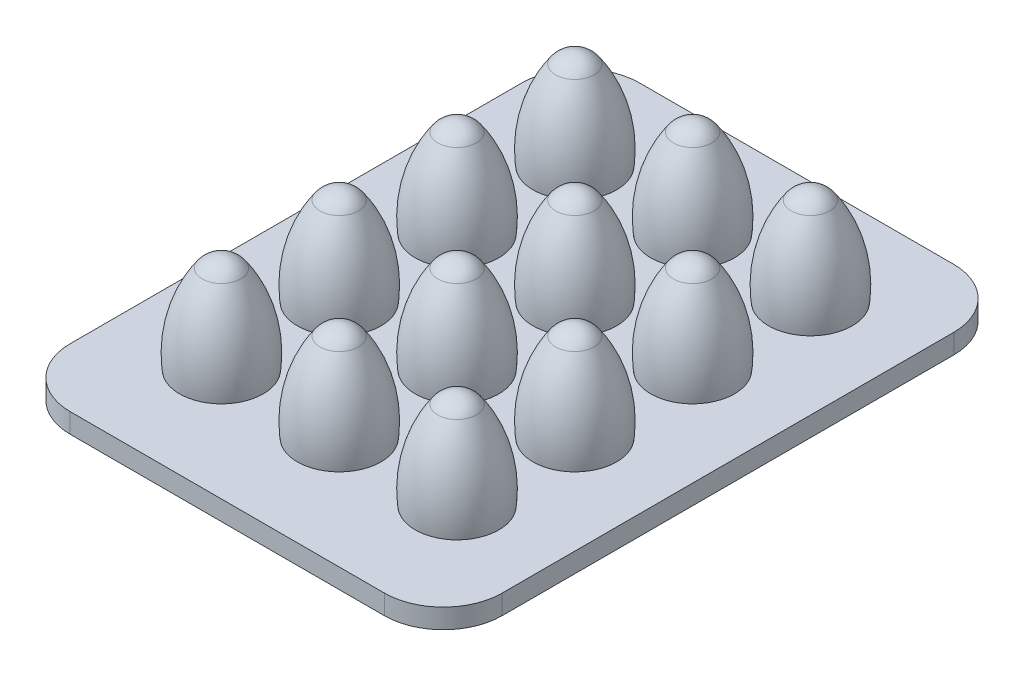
ISO-10303-21;
HEADER;
FILE_DESCRIPTION(('STEP AP214'),'2;1');
FILE_NAME('part.step','',(''),(''),'','','');
FILE_SCHEMA(('AUTOMOTIVE_DESIGN { 1 0 10303 214 1 1 1 1 }'));
ENDSEC;
DATA;
#1=APPLICATION_CONTEXT('core data for automotive mechanical design processes');
#2=APPLICATION_PROTOCOL_DEFINITION('international standard','automotive_design',2000,#1);
#3=PRODUCT_CONTEXT('',#1,'mechanical');
#4=PRODUCT('Part','Part','',(#3));
#5=PRODUCT_RELATED_PRODUCT_CATEGORY('part','',(#4));
#6=PRODUCT_DEFINITION_FORMATION('','',#4);
#7=PRODUCT_DEFINITION_CONTEXT('part definition',#1,'design');
#8=PRODUCT_DEFINITION('design','',#6,#7);
#9=PRODUCT_DEFINITION_SHAPE('','',#8);
#10=(LENGTH_UNIT() NAMED_UNIT(*) SI_UNIT(.MILLI.,.METRE.));
#11=(NAMED_UNIT(*) PLANE_ANGLE_UNIT() SI_UNIT($,.RADIAN.));
#12=(NAMED_UNIT(*) SI_UNIT($,.STERADIAN.) SOLID_ANGLE_UNIT());
#13=UNCERTAINTY_MEASURE_WITH_UNIT(LENGTH_MEASURE(1.E-05),#10,'distance_accuracy_value','');
#14=(GEOMETRIC_REPRESENTATION_CONTEXT(3) GLOBAL_UNCERTAINTY_ASSIGNED_CONTEXT((#13)) GLOBAL_UNIT_ASSIGNED_CONTEXT((#10,
#11,#12)) REPRESENTATION_CONTEXT('',''));
#15=CARTESIAN_POINT('',(0.,0.,0.));
#16=DIRECTION('',(0.,0.,1.));
#17=DIRECTION('',(1.,0.,0.));
#18=AXIS2_PLACEMENT_3D('',#15,#16,#17);
#19=CARTESIAN_POINT('',(-140.,25.,27.));
#20=DIRECTION('',(0.,-1.,0.));
#21=DIRECTION('',(0.,0.,-1.));
#22=AXIS2_PLACEMENT_3D('',#19,#20,#21);
#23=PLANE('',#22);
#24=CARTESIAN_POINT('',(-120.,25.,-180.));
#25=DIRECTION('',(0.,-1.,0.));
#26=DIRECTION('',(0.,0.,-1.));
#27=AXIS2_PLACEMENT_3D('',#24,#25,#26);
#28=CIRCLE('',#27,21.3167639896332);
#29=CARTESIAN_POINT('',(-120.,25.,-201.316763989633));
#30=VERTEX_POINT('',#29);
#31=EDGE_CURVE('E46',#30,#30,#28,.T.);
#32=ORIENTED_EDGE('',*,*,#31,.T.);
#33=EDGE_LOOP('',(#32));
#34=FACE_BOUND('',#33,.T.);
#35=CARTESIAN_POINT('',(-120.,25.,-120.));
#36=DIRECTION('',(0.,-1.,0.));
#37=DIRECTION('',(0.,0.,-1.));
#38=AXIS2_PLACEMENT_3D('',#35,#36,#37);
#39=CIRCLE('',#38,21.3167639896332);
#40=CARTESIAN_POINT('',(-120.,25.,-141.316763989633));
#41=VERTEX_POINT('',#40);
#42=EDGE_CURVE('E316',#41,#41,#39,.T.);
#43=ORIENTED_EDGE('',*,*,#42,.T.);
#44=EDGE_LOOP('',(#43));
#45=FACE_BOUND('',#44,.T.);
#46=CARTESIAN_POINT('',(-120.,25.,-60.));
#47=DIRECTION('',(0.,-1.,0.));
#48=DIRECTION('',(0.,0.,-1.));
#49=AXIS2_PLACEMENT_3D('',#46,#47,#48);
#50=CIRCLE('',#49,21.3167639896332);
#51=CARTESIAN_POINT('',(-120.,25.,-81.3167639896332));
#52=VERTEX_POINT('',#51);
#53=EDGE_CURVE('E326',#52,#52,#50,.T.);
#54=ORIENTED_EDGE('',*,*,#53,.T.);
#55=EDGE_LOOP('',(#54));
#56=FACE_BOUND('',#55,.T.);
#57=CARTESIAN_POINT('',(-120.,25.,0.));
#58=DIRECTION('',(0.,-1.,0.));
#59=DIRECTION('',(0.,0.,-1.));
#60=AXIS2_PLACEMENT_3D('',#57,#58,#59);
#61=CIRCLE('',#60,21.3167639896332);
#62=CARTESIAN_POINT('',(-120.,25.,-21.3167639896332));
#63=VERTEX_POINT('',#62);
#64=EDGE_CURVE('E336',#63,#63,#61,.T.);
#65=ORIENTED_EDGE('',*,*,#64,.T.);
#66=EDGE_LOOP('',(#65));
#67=FACE_BOUND('',#66,.T.);
#68=CARTESIAN_POINT('',(-60.,25.,0.));
#69=DIRECTION('',(0.,-1.,0.));
#70=DIRECTION('',(0.,0.,-1.));
#71=AXIS2_PLACEMENT_3D('',#68,#69,#70);
#72=CIRCLE('',#71,21.3167639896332);
#73=CARTESIAN_POINT('',(-60.,25.,-21.3167639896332));
#74=VERTEX_POINT('',#73);
#75=EDGE_CURVE('E346',#74,#74,#72,.T.);
#76=ORIENTED_EDGE('',*,*,#75,.T.);
#77=EDGE_LOOP('',(#76));
#78=FACE_BOUND('',#77,.T.);
#79=CARTESIAN_POINT('',(-60.,25.,-60.));
#80=DIRECTION('',(0.,-1.,0.));
#81=DIRECTION('',(0.,0.,-1.));
#82=AXIS2_PLACEMENT_3D('',#79,#80,#81);
#83=CIRCLE('',#82,21.3167639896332);
#84=CARTESIAN_POINT('',(-60.,25.,-81.3167639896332));
#85=VERTEX_POINT('',#84);
#86=EDGE_CURVE('E356',#85,#85,#83,.T.);
#87=ORIENTED_EDGE('',*,*,#86,.T.);
#88=EDGE_LOOP('',(#87));
#89=FACE_BOUND('',#88,.T.);
#90=CARTESIAN_POINT('',(-60.,25.,-120.));
#91=DIRECTION('',(0.,-1.,0.));
#92=DIRECTION('',(0.,0.,-1.));
#93=AXIS2_PLACEMENT_3D('',#90,#91,#92);
#94=CIRCLE('',#93,21.3167639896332);
#95=CARTESIAN_POINT('',(-60.,25.,-141.316763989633));
#96=VERTEX_POINT('',#95);
#97=EDGE_CURVE('E366',#96,#96,#94,.T.);
#98=ORIENTED_EDGE('',*,*,#97,.T.);
#99=EDGE_LOOP('',(#98));
#100=FACE_BOUND('',#99,.T.);
#101=CARTESIAN_POINT('',(-60.,25.,-180.));
#102=DIRECTION('',(0.,-1.,0.));
#103=DIRECTION('',(0.,0.,-1.));
#104=AXIS2_PLACEMENT_3D('',#101,#102,#103);
#105=CIRCLE('',#104,21.3167639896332);
#106=CARTESIAN_POINT('',(-60.,25.,-201.316763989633));
#107=VERTEX_POINT('',#106);
#108=EDGE_CURVE('E376',#107,#107,#105,.T.);
#109=ORIENTED_EDGE('',*,*,#108,.T.);
#110=EDGE_LOOP('',(#109));
#111=FACE_BOUND('',#110,.T.);
#112=CARTESIAN_POINT('',(0.,25.,-180.));
#113=DIRECTION('',(0.,-1.,0.));
#114=DIRECTION('',(0.,0.,-1.));
#115=AXIS2_PLACEMENT_3D('',#112,#113,#114);
#116=CIRCLE('',#115,21.3167639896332);
#117=CARTESIAN_POINT('',(0.,25.,-201.316763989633));
#118=VERTEX_POINT('',#117);
#119=EDGE_CURVE('E386',#118,#118,#116,.T.);
#120=ORIENTED_EDGE('',*,*,#119,.T.);
#121=EDGE_LOOP('',(#120));
#122=FACE_BOUND('',#121,.T.);
#123=CARTESIAN_POINT('',(0.,25.,-120.));
#124=DIRECTION('',(0.,-1.,0.));
#125=DIRECTION('',(0.,0.,-1.));
#126=AXIS2_PLACEMENT_3D('',#123,#124,#125);
#127=CIRCLE('',#126,21.3167639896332);
#128=CARTESIAN_POINT('',(0.,25.,-141.316763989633));
#129=VERTEX_POINT('',#128);
#130=EDGE_CURVE('E396',#129,#129,#127,.T.);
#131=ORIENTED_EDGE('',*,*,#130,.T.);
#132=EDGE_LOOP('',(#131));
#133=FACE_BOUND('',#132,.T.);
#134=CARTESIAN_POINT('',(0.,25.,-60.));
#135=DIRECTION('',(0.,-1.,0.));
#136=DIRECTION('',(0.,0.,-1.));
#137=AXIS2_PLACEMENT_3D('',#134,#135,#136);
#138=CIRCLE('',#137,21.3167639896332);
#139=CARTESIAN_POINT('',(0.,25.,-81.3167639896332));
#140=VERTEX_POINT('',#139);
#141=EDGE_CURVE('E406',#140,#140,#138,.T.);
#142=ORIENTED_EDGE('',*,*,#141,.T.);
#143=EDGE_LOOP('',(#142));
#144=FACE_BOUND('',#143,.T.);
#145=CARTESIAN_POINT('',(0.,25.,0.));
#146=DIRECTION('',(0.,-1.,0.));
#147=DIRECTION('',(0.,0.,-1.));
#148=AXIS2_PLACEMENT_3D('',#145,#146,#147);
#149=CIRCLE('',#148,21.3167639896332);
#150=CARTESIAN_POINT('',(0.,25.,-21.3167639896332));
#151=VERTEX_POINT('',#150);
#152=EDGE_CURVE('E416',#151,#151,#149,.T.);
#153=ORIENTED_EDGE('',*,*,#152,.T.);
#154=EDGE_LOOP('',(#153));
#155=FACE_BOUND('',#154,.T.);
#156=DIRECTION('',(-1.,0.,0.));
#157=VECTOR('',#156,1.);
#158=CARTESIAN_POINT('',(20.,25.,-233.));
#159=LINE('',#158,#157);
#160=CARTESIAN_POINT('',(20.,25.,-233.));
#161=VERTEX_POINT('',#160);
#162=CARTESIAN_POINT('',(-140.,25.,-233.));
#163=VERTEX_POINT('',#162);
#164=EDGE_CURVE('E180',#161,#163,#159,.T.);
#165=ORIENTED_EDGE('',*,*,#164,.T.);
#166=CARTESIAN_POINT('',(-140.,25.,-203.));
#167=DIRECTION('',(0.,-1.,0.));
#168=DIRECTION('',(0.,0.,-1.));
#169=AXIS2_PLACEMENT_3D('',#166,#167,#168);
#170=CIRCLE('',#169,29.9999999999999);
#171=CARTESIAN_POINT('',(-170.,25.,-203.));
#172=VERTEX_POINT('',#171);
#173=EDGE_CURVE('E285',#172,#163,#170,.T.);
#174=ORIENTED_EDGE('',*,*,#173,.F.);
#175=DIRECTION('',(0.,0.,-1.));
#176=VECTOR('',#175,1.);
#177=CARTESIAN_POINT('',(-170.,25.,27.));
#178=LINE('',#177,#176);
#179=CARTESIAN_POINT('',(-170.,25.,27.));
#180=VERTEX_POINT('',#179);
#181=EDGE_CURVE('E269',#180,#172,#178,.T.);
#182=ORIENTED_EDGE('',*,*,#181,.F.);
#183=CARTESIAN_POINT('',(-140.,25.,27.));
#184=DIRECTION('',(0.,-1.,0.));
#185=DIRECTION('',(0.,0.,-1.));
#186=AXIS2_PLACEMENT_3D('',#183,#184,#185);
#187=CIRCLE('',#186,30.);
#188=CARTESIAN_POINT('',(-140.,25.,57.));
#189=VERTEX_POINT('',#188);
#190=EDGE_CURVE('E251',#189,#180,#187,.T.);
#191=ORIENTED_EDGE('',*,*,#190,.F.);
#192=DIRECTION('',(-1.,0.,0.));
#193=VECTOR('',#192,1.);
#194=CARTESIAN_POINT('',(20.,25.,57.));
#195=LINE('',#194,#193);
#196=CARTESIAN_POINT('',(20.,25.,57.));
#197=VERTEX_POINT('',#196);
#198=EDGE_CURVE('E233',#197,#189,#195,.T.);
#199=ORIENTED_EDGE('',*,*,#198,.F.);
#200=CARTESIAN_POINT('',(20.,25.,27.));
#201=DIRECTION('',(0.,-1.,0.));
#202=DIRECTION('',(0.,0.,-1.));
#203=AXIS2_PLACEMENT_3D('',#200,#201,#202);
#204=CIRCLE('',#203,30.);
#205=CARTESIAN_POINT('',(50.,25.,27.));
#206=VERTEX_POINT('',#205);
#207=EDGE_CURVE('E215',#206,#197,#204,.T.);
#208=ORIENTED_EDGE('',*,*,#207,.F.);
#209=DIRECTION('',(0.,0.,1.));
#210=VECTOR('',#209,1.);
#211=CARTESIAN_POINT('',(49.9999999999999,25.,-203.));
#212=LINE('',#211,#210);
#213=CARTESIAN_POINT('',(49.9999999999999,25.,-203.));
#214=VERTEX_POINT('',#213);
#215=EDGE_CURVE('E198',#214,#206,#212,.T.);
#216=ORIENTED_EDGE('',*,*,#215,.F.);
#217=CARTESIAN_POINT('',(20.,25.,-203.));
#218=DIRECTION('',(0.,-1.,0.));
#219=DIRECTION('',(0.,0.,-1.));
#220=AXIS2_PLACEMENT_3D('',#217,#218,#219);
#221=CIRCLE('',#220,30.);
#222=EDGE_CURVE('E186',#161,#214,#221,.T.);
#223=ORIENTED_EDGE('',*,*,#222,.F.);
#224=EDGE_LOOP('',(#165,#174,#182,#191,#199,#208,#216,#223));
#225=FACE_BOUND('',#224,.T.);
#226=ADVANCED_FACE('F43',(#34,#45,#56,#67,#78,#89,#100,#111,#122,#133,#144,#155,#225),#23,.F.);
#227=CARTESIAN_POINT('',(0.,32.3837209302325,0.));
#228=DIRECTION('',(0.,-1.,0.));
#229=DIRECTION('',(0.,0.,-1.));
#230=AXIS2_PLACEMENT_3D('',#227,#228,#229);
#231=DEGENERATE_TOROIDAL_SURFACE('',#230,43.2624947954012,65.,.F.);
#232=CARTESIAN_POINT('',(0.,14.4961240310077,0.));
#233=DIRECTION('',(0.,-1.,0.));
#234=DIRECTION('',(0.,0.,-1.));
#235=AXIS2_PLACEMENT_3D('',#232,#233,#234);
#236=CIRCLE('',#235,19.2277754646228);
#237=CARTESIAN_POINT('',(0.,14.4961240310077,-19.2277754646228));
#238=VERTEX_POINT('',#237);
#239=EDGE_CURVE('E410',#238,#238,#236,.T.);
#240=ORIENTED_EDGE('',*,*,#239,.T.);
#241=EDGE_LOOP('',(#240));
#242=FACE_BOUND('',#241,.T.);
#243=ORIENTED_EDGE('',*,*,#152,.F.);
#244=EDGE_LOOP('',(#243));
#245=FACE_BOUND('',#244,.T.);
#246=ADVANCED_FACE('F464',(#242,#245),#231,.T.);
#247=CARTESIAN_POINT('',(0.,20.,0.));
#248=DIRECTION('',(0.,-1.,0.));
#249=DIRECTION('',(1.,0.,0.));
#250=AXIS2_PLACEMENT_3D('',#247,#248,#249);
#251=SPHERICAL_SURFACE('',#250,20.);
#252=ORIENTED_EDGE('',*,*,#239,.F.);
#253=EDGE_LOOP('',(#252));
#254=FACE_BOUND('',#253,.T.);
#255=ADVANCED_FACE('F469',(#254),#251,.F.);
#256=CARTESIAN_POINT('',(0.,32.3837209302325,-60.));
#257=DIRECTION('',(0.,-1.,0.));
#258=DIRECTION('',(0.,0.,-1.));
#259=AXIS2_PLACEMENT_3D('',#256,#257,#258);
#260=DEGENERATE_TOROIDAL_SURFACE('',#259,43.2624947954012,65.,.F.);
#261=CARTESIAN_POINT('',(0.,14.4961240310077,-60.));
#262=DIRECTION('',(0.,-1.,0.));
#263=DIRECTION('',(0.,0.,-1.));
#264=AXIS2_PLACEMENT_3D('',#261,#262,#263);
#265=CIRCLE('',#264,19.2277754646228);
#266=CARTESIAN_POINT('',(0.,14.4961240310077,-79.2277754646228));
#267=VERTEX_POINT('',#266);
#268=EDGE_CURVE('E400',#267,#267,#265,.T.);
#269=ORIENTED_EDGE('',*,*,#268,.T.);
#270=EDGE_LOOP('',(#269));
#271=FACE_BOUND('',#270,.T.);
#272=ORIENTED_EDGE('',*,*,#141,.F.);
#273=EDGE_LOOP('',(#272));
#274=FACE_BOUND('',#273,.T.);
#275=ADVANCED_FACE('F554',(#271,#274),#260,.T.);
#276=CARTESIAN_POINT('',(0.,20.,-60.));
#277=DIRECTION('',(0.,-1.,0.));
#278=DIRECTION('',(1.,0.,0.));
#279=AXIS2_PLACEMENT_3D('',#276,#277,#278);
#280=SPHERICAL_SURFACE('',#279,20.);
#281=ORIENTED_EDGE('',*,*,#268,.F.);
#282=EDGE_LOOP('',(#281));
#283=FACE_BOUND('',#282,.T.);
#284=ADVANCED_FACE('F561',(#283),#280,.F.);
#285=CARTESIAN_POINT('',(0.,32.3837209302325,-120.));
#286=DIRECTION('',(0.,-1.,0.));
#287=DIRECTION('',(0.,0.,-1.));
#288=AXIS2_PLACEMENT_3D('',#285,#286,#287);
#289=DEGENERATE_TOROIDAL_SURFACE('',#288,43.2624947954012,65.,.F.);
#290=CARTESIAN_POINT('',(0.,14.4961240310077,-120.));
#291=DIRECTION('',(0.,-1.,0.));
#292=DIRECTION('',(0.,0.,-1.));
#293=AXIS2_PLACEMENT_3D('',#290,#291,#292);
#294=CIRCLE('',#293,19.2277754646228);
#295=CARTESIAN_POINT('',(0.,14.4961240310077,-139.227775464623));
#296=VERTEX_POINT('',#295);
#297=EDGE_CURVE('E390',#296,#296,#294,.T.);
#298=ORIENTED_EDGE('',*,*,#297,.T.);
#299=EDGE_LOOP('',(#298));
#300=FACE_BOUND('',#299,.T.);
#301=ORIENTED_EDGE('',*,*,#130,.F.);
#302=EDGE_LOOP('',(#301));
#303=FACE_BOUND('',#302,.T.);
#304=ADVANCED_FACE('F564',(#300,#303),#289,.T.);
#305=CARTESIAN_POINT('',(0.,20.,-120.));
#306=DIRECTION('',(0.,-1.,0.));
#307=DIRECTION('',(1.,0.,0.));
#308=AXIS2_PLACEMENT_3D('',#305,#306,#307);
#309=SPHERICAL_SURFACE('',#308,20.);
#310=ORIENTED_EDGE('',*,*,#297,.F.);
#311=EDGE_LOOP('',(#310));
#312=FACE_BOUND('',#311,.T.);
#313=ADVANCED_FACE('F577',(#312),#309,.F.);
#314=CARTESIAN_POINT('',(0.,32.3837209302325,-180.));
#315=DIRECTION('',(0.,-1.,0.));
#316=DIRECTION('',(0.,0.,-1.));
#317=AXIS2_PLACEMENT_3D('',#314,#315,#316);
#318=DEGENERATE_TOROIDAL_SURFACE('',#317,43.2624947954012,65.,.F.);
#319=CARTESIAN_POINT('',(0.,14.4961240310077,-180.));
#320=DIRECTION('',(0.,-1.,0.));
#321=DIRECTION('',(0.,0.,-1.));
#322=AXIS2_PLACEMENT_3D('',#319,#320,#321);
#323=CIRCLE('',#322,19.2277754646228);
#324=CARTESIAN_POINT('',(0.,14.4961240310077,-199.227775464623));
#325=VERTEX_POINT('',#324);
#326=EDGE_CURVE('E380',#325,#325,#323,.T.);
#327=ORIENTED_EDGE('',*,*,#326,.T.);
#328=EDGE_LOOP('',(#327));
#329=FACE_BOUND('',#328,.T.);
#330=ORIENTED_EDGE('',*,*,#119,.F.);
#331=EDGE_LOOP('',(#330));
#332=FACE_BOUND('',#331,.T.);
#333=ADVANCED_FACE('F580',(#329,#332),#318,.T.);
#334=CARTESIAN_POINT('',(0.,20.,-180.));
#335=DIRECTION('',(0.,-1.,0.));
#336=DIRECTION('',(1.,0.,0.));
#337=AXIS2_PLACEMENT_3D('',#334,#335,#336);
#338=SPHERICAL_SURFACE('',#337,20.);
#339=ORIENTED_EDGE('',*,*,#326,.F.);
#340=EDGE_LOOP('',(#339));
#341=FACE_BOUND('',#340,.T.);
#342=ADVANCED_FACE('F593',(#341),#338,.F.);
#343=CARTESIAN_POINT('',(-60.,32.3837209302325,-180.));
#344=DIRECTION('',(0.,-1.,0.));
#345=DIRECTION('',(0.,0.,-1.));
#346=AXIS2_PLACEMENT_3D('',#343,#344,#345);
#347=DEGENERATE_TOROIDAL_SURFACE('',#346,43.2624947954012,65.,.F.);
#348=CARTESIAN_POINT('',(-60.,14.4961240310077,-180.));
#349=DIRECTION('',(0.,-1.,0.));
#350=DIRECTION('',(0.,0.,-1.));
#351=AXIS2_PLACEMENT_3D('',#348,#349,#350);
#352=CIRCLE('',#351,19.2277754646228);
#353=CARTESIAN_POINT('',(-60.,14.4961240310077,-199.227775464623));
#354=VERTEX_POINT('',#353);
#355=EDGE_CURVE('E370',#354,#354,#352,.T.);
#356=ORIENTED_EDGE('',*,*,#355,.T.);
#357=EDGE_LOOP('',(#356));
#358=FACE_BOUND('',#357,.T.);
#359=ORIENTED_EDGE('',*,*,#108,.F.);
#360=EDGE_LOOP('',(#359));
#361=FACE_BOUND('',#360,.T.);
#362=ADVANCED_FACE('F596',(#358,#361),#347,.T.);
#363=CARTESIAN_POINT('',(-60.,20.,-180.));
#364=DIRECTION('',(0.,-1.,0.));
#365=DIRECTION('',(1.,0.,0.));
#366=AXIS2_PLACEMENT_3D('',#363,#364,#365);
#367=SPHERICAL_SURFACE('',#366,20.);
#368=ORIENTED_EDGE('',*,*,#355,.F.);
#369=EDGE_LOOP('',(#368));
#370=FACE_BOUND('',#369,.T.);
#371=ADVANCED_FACE('F609',(#370),#367,.F.);
#372=CARTESIAN_POINT('',(-60.,32.3837209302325,-120.));
#373=DIRECTION('',(0.,-1.,0.));
#374=DIRECTION('',(0.,0.,-1.));
#375=AXIS2_PLACEMENT_3D('',#372,#373,#374);
#376=DEGENERATE_TOROIDAL_SURFACE('',#375,43.2624947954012,65.,.F.);
#377=CARTESIAN_POINT('',(-60.,14.4961240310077,-120.));
#378=DIRECTION('',(0.,-1.,0.));
#379=DIRECTION('',(0.,0.,-1.));
#380=AXIS2_PLACEMENT_3D('',#377,#378,#379);
#381=CIRCLE('',#380,19.2277754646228);
#382=CARTESIAN_POINT('',(-60.,14.4961240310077,-139.227775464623));
#383=VERTEX_POINT('',#382);
#384=EDGE_CURVE('E360',#383,#383,#381,.T.);
#385=ORIENTED_EDGE('',*,*,#384,.T.);
#386=EDGE_LOOP('',(#385));
#387=FACE_BOUND('',#386,.T.);
#388=ORIENTED_EDGE('',*,*,#97,.F.);
#389=EDGE_LOOP('',(#388));
#390=FACE_BOUND('',#389,.T.);
#391=ADVANCED_FACE('F612',(#387,#390),#376,.T.);
#392=CARTESIAN_POINT('',(-60.,20.,-120.));
#393=DIRECTION('',(0.,-1.,0.));
#394=DIRECTION('',(1.,0.,0.));
#395=AXIS2_PLACEMENT_3D('',#392,#393,#394);
#396=SPHERICAL_SURFACE('',#395,20.);
#397=ORIENTED_EDGE('',*,*,#384,.F.);
#398=EDGE_LOOP('',(#397));
#399=FACE_BOUND('',#398,.T.);
#400=ADVANCED_FACE('F625',(#399),#396,.F.);
#401=CARTESIAN_POINT('',(-60.,32.3837209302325,-60.));
#402=DIRECTION('',(0.,-1.,0.));
#403=DIRECTION('',(0.,0.,-1.));
#404=AXIS2_PLACEMENT_3D('',#401,#402,#403);
#405=DEGENERATE_TOROIDAL_SURFACE('',#404,43.2624947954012,65.,.F.);
#406=CARTESIAN_POINT('',(-60.,14.4961240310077,-60.));
#407=DIRECTION('',(0.,-1.,0.));
#408=DIRECTION('',(0.,0.,-1.));
#409=AXIS2_PLACEMENT_3D('',#406,#407,#408);
#410=CIRCLE('',#409,19.2277754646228);
#411=CARTESIAN_POINT('',(-60.,14.4961240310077,-79.2277754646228));
#412=VERTEX_POINT('',#411);
#413=EDGE_CURVE('E350',#412,#412,#410,.T.);
#414=ORIENTED_EDGE('',*,*,#413,.T.);
#415=EDGE_LOOP('',(#414));
#416=FACE_BOUND('',#415,.T.);
#417=ORIENTED_EDGE('',*,*,#86,.F.);
#418=EDGE_LOOP('',(#417));
#419=FACE_BOUND('',#418,.T.);
#420=ADVANCED_FACE('F628',(#416,#419),#405,.T.);
#421=CARTESIAN_POINT('',(-60.,20.,-60.));
#422=DIRECTION('',(0.,-1.,0.));
#423=DIRECTION('',(1.,0.,0.));
#424=AXIS2_PLACEMENT_3D('',#421,#422,#423);
#425=SPHERICAL_SURFACE('',#424,20.);
#426=ORIENTED_EDGE('',*,*,#413,.F.);
#427=EDGE_LOOP('',(#426));
#428=FACE_BOUND('',#427,.T.);
#429=ADVANCED_FACE('F641',(#428),#425,.F.);
#430=CARTESIAN_POINT('',(-60.,32.3837209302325,0.));
#431=DIRECTION('',(0.,-1.,0.));
#432=DIRECTION('',(0.,0.,-1.));
#433=AXIS2_PLACEMENT_3D('',#430,#431,#432);
#434=DEGENERATE_TOROIDAL_SURFACE('',#433,43.2624947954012,65.,.F.);
#435=CARTESIAN_POINT('',(-60.,14.4961240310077,0.));
#436=DIRECTION('',(0.,-1.,0.));
#437=DIRECTION('',(0.,0.,-1.));
#438=AXIS2_PLACEMENT_3D('',#435,#436,#437);
#439=CIRCLE('',#438,19.2277754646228);
#440=CARTESIAN_POINT('',(-60.,14.4961240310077,-19.2277754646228));
#441=VERTEX_POINT('',#440);
#442=EDGE_CURVE('E340',#441,#441,#439,.T.);
#443=ORIENTED_EDGE('',*,*,#442,.T.);
#444=EDGE_LOOP('',(#443));
#445=FACE_BOUND('',#444,.T.);
#446=ORIENTED_EDGE('',*,*,#75,.F.);
#447=EDGE_LOOP('',(#446));
#448=FACE_BOUND('',#447,.T.);
#449=ADVANCED_FACE('F644',(#445,#448),#434,.T.);
#450=CARTESIAN_POINT('',(-60.,20.,0.));
#451=DIRECTION('',(0.,-1.,0.));
#452=DIRECTION('',(1.,0.,0.));
#453=AXIS2_PLACEMENT_3D('',#450,#451,#452);
#454=SPHERICAL_SURFACE('',#453,20.);
#455=ORIENTED_EDGE('',*,*,#442,.F.);
#456=EDGE_LOOP('',(#455));
#457=FACE_BOUND('',#456,.T.);
#458=ADVANCED_FACE('F657',(#457),#454,.F.);
#459=CARTESIAN_POINT('',(-120.,32.3837209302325,0.));
#460=DIRECTION('',(0.,-1.,0.));
#461=DIRECTION('',(0.,0.,-1.));
#462=AXIS2_PLACEMENT_3D('',#459,#460,#461);
#463=DEGENERATE_TOROIDAL_SURFACE('',#462,43.2624947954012,65.,.F.);
#464=CARTESIAN_POINT('',(-120.,14.4961240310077,0.));
#465=DIRECTION('',(0.,-1.,0.));
#466=DIRECTION('',(0.,0.,-1.));
#467=AXIS2_PLACEMENT_3D('',#464,#465,#466);
#468=CIRCLE('',#467,19.2277754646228);
#469=CARTESIAN_POINT('',(-120.,14.4961240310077,-19.2277754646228));
#470=VERTEX_POINT('',#469);
#471=EDGE_CURVE('E330',#470,#470,#468,.T.);
#472=ORIENTED_EDGE('',*,*,#471,.T.);
#473=EDGE_LOOP('',(#472));
#474=FACE_BOUND('',#473,.T.);
#475=ORIENTED_EDGE('',*,*,#64,.F.);
#476=EDGE_LOOP('',(#475));
#477=FACE_BOUND('',#476,.T.);
#478=ADVANCED_FACE('F660',(#474,#477),#463,.T.);
#479=CARTESIAN_POINT('',(-120.,20.,0.));
#480=DIRECTION('',(0.,-1.,0.));
#481=DIRECTION('',(1.,0.,0.));
#482=AXIS2_PLACEMENT_3D('',#479,#480,#481);
#483=SPHERICAL_SURFACE('',#482,20.);
#484=ORIENTED_EDGE('',*,*,#471,.F.);
#485=EDGE_LOOP('',(#484));
#486=FACE_BOUND('',#485,.T.);
#487=ADVANCED_FACE('F672',(#486),#483,.F.);
#488=CARTESIAN_POINT('',(-120.,32.3837209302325,-60.));
#489=DIRECTION('',(0.,-1.,0.));
#490=DIRECTION('',(0.,0.,-1.));
#491=AXIS2_PLACEMENT_3D('',#488,#489,#490);
#492=DEGENERATE_TOROIDAL_SURFACE('',#491,43.2624947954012,65.,.F.);
#493=CARTESIAN_POINT('',(-120.,14.4961240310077,-60.));
#494=DIRECTION('',(0.,-1.,0.));
#495=DIRECTION('',(0.,0.,-1.));
#496=AXIS2_PLACEMENT_3D('',#493,#494,#495);
#497=CIRCLE('',#496,19.2277754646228);
#498=CARTESIAN_POINT('',(-120.,14.4961240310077,-79.2277754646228));
#499=VERTEX_POINT('',#498);
#500=EDGE_CURVE('E320',#499,#499,#497,.T.);
#501=ORIENTED_EDGE('',*,*,#500,.T.);
#502=EDGE_LOOP('',(#501));
#503=FACE_BOUND('',#502,.T.);
#504=ORIENTED_EDGE('',*,*,#53,.F.);
#505=EDGE_LOOP('',(#504));
#506=FACE_BOUND('',#505,.T.);
#507=ADVANCED_FACE('F459',(#503,#506),#492,.T.);
#508=CARTESIAN_POINT('',(-120.,20.,-60.));
#509=DIRECTION('',(0.,-1.,0.));
#510=DIRECTION('',(1.,0.,0.));
#511=AXIS2_PLACEMENT_3D('',#508,#509,#510);
#512=SPHERICAL_SURFACE('',#511,20.);
#513=ORIENTED_EDGE('',*,*,#500,.F.);
#514=EDGE_LOOP('',(#513));
#515=FACE_BOUND('',#514,.T.);
#516=ADVANCED_FACE('F449',(#515),#512,.F.);
#517=CARTESIAN_POINT('',(-120.,32.3837209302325,-120.));
#518=DIRECTION('',(0.,-1.,0.));
#519=DIRECTION('',(0.,0.,-1.));
#520=AXIS2_PLACEMENT_3D('',#517,#518,#519);
#521=DEGENERATE_TOROIDAL_SURFACE('',#520,43.2624947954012,65.,.F.);
#522=CARTESIAN_POINT('',(-120.,14.4961240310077,-120.));
#523=DIRECTION('',(0.,-1.,0.));
#524=DIRECTION('',(0.,0.,-1.));
#525=AXIS2_PLACEMENT_3D('',#522,#523,#524);
#526=CIRCLE('',#525,19.2277754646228);
#527=CARTESIAN_POINT('',(-120.,14.4961240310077,-139.227775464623));
#528=VERTEX_POINT('',#527);
#529=EDGE_CURVE('E312',#528,#528,#526,.T.);
#530=ORIENTED_EDGE('',*,*,#529,.T.);
#531=EDGE_LOOP('',(#530));
#532=FACE_BOUND('',#531,.T.);
#533=ORIENTED_EDGE('',*,*,#42,.F.);
#534=EDGE_LOOP('',(#533));
#535=FACE_BOUND('',#534,.T.);
#536=ADVANCED_FACE('F446',(#532,#535),#521,.T.);
#537=CARTESIAN_POINT('',(-120.,20.,-120.));
#538=DIRECTION('',(0.,-1.,0.));
#539=DIRECTION('',(1.,0.,0.));
#540=AXIS2_PLACEMENT_3D('',#537,#538,#539);
#541=SPHERICAL_SURFACE('',#540,20.);
#542=ORIENTED_EDGE('',*,*,#529,.F.);
#543=EDGE_LOOP('',(#542));
#544=FACE_BOUND('',#543,.T.);
#545=ADVANCED_FACE('F448',(#544),#541,.F.);
#546=CARTESIAN_POINT('',(-120.,32.3837209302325,-180.));
#547=DIRECTION('',(0.,-1.,0.));
#548=DIRECTION('',(0.,0.,-1.));
#549=AXIS2_PLACEMENT_3D('',#546,#547,#548);
#550=DEGENERATE_TOROIDAL_SURFACE('',#549,43.2624947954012,65.,.F.);
#551=CARTESIAN_POINT('',(-120.,14.4961240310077,-180.));
#552=DIRECTION('',(0.,-1.,0.));
#553=DIRECTION('',(0.,0.,-1.));
#554=AXIS2_PLACEMENT_3D('',#551,#552,#553);
#555=CIRCLE('',#554,19.2277754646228);
#556=CARTESIAN_POINT('',(-120.,14.4961240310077,-199.227775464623));
#557=VERTEX_POINT('',#556);
#558=EDGE_CURVE('E294',#557,#557,#555,.T.);
#559=ORIENTED_EDGE('',*,*,#558,.T.);
#560=EDGE_LOOP('',(#559));
#561=FACE_BOUND('',#560,.T.);
#562=ORIENTED_EDGE('',*,*,#31,.F.);
#563=EDGE_LOOP('',(#562));
#564=FACE_BOUND('',#563,.T.);
#565=ADVANCED_FACE('F456',(#561,#564),#550,.T.);
#566=CARTESIAN_POINT('',(-120.,20.,-180.));
#567=DIRECTION('',(0.,-1.,0.));
#568=DIRECTION('',(1.,0.,0.));
#569=AXIS2_PLACEMENT_3D('',#566,#567,#568);
#570=SPHERICAL_SURFACE('',#569,20.);
#571=ORIENTED_EDGE('',*,*,#558,.F.);
#572=EDGE_LOOP('',(#571));
#573=FACE_BOUND('',#572,.T.);
#574=ADVANCED_FACE('F476',(#573),#570,.F.);
#575=CARTESIAN_POINT('',(-140.,22.,-203.));
#576=DIRECTION('',(0.,-1.,0.));
#577=DIRECTION('',(0.,0.,-1.));
#578=AXIS2_PLACEMENT_3D('',#575,#576,#577);
#579=CYLINDRICAL_SURFACE('',#578,26.9999999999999);
#580=DIRECTION('',(0.,-1.,0.));
#581=VECTOR('',#580,1.);
#582=CARTESIAN_POINT('',(-167.,22.,-203.));
#583=LINE('',#582,#581);
#584=CARTESIAN_POINT('',(-167.,22.,-203.));
#585=VERTEX_POINT('',#584);
#586=CARTESIAN_POINT('',(-167.,15.,-203.));
#587=VERTEX_POINT('',#586);
#588=EDGE_CURVE('E266',#585,#587,#583,.T.);
#589=ORIENTED_EDGE('',*,*,#588,.T.);
#590=CARTESIAN_POINT('',(-140.,15.,-203.));
#591=DIRECTION('',(0.,-1.,0.));
#592=DIRECTION('',(0.,0.,-1.));
#593=AXIS2_PLACEMENT_3D('',#590,#591,#592);
#594=CIRCLE('',#593,26.9999999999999);
#595=CARTESIAN_POINT('',(-140.,15.,-230.));
#596=VERTEX_POINT('',#595);
#597=EDGE_CURVE('E291',#587,#596,#594,.T.);
#598=ORIENTED_EDGE('',*,*,#597,.T.);
#599=DIRECTION('',(0.,-1.,0.));
#600=VECTOR('',#599,1.);
#601=CARTESIAN_POINT('',(-140.,22.,-230.));
#602=LINE('',#601,#600);
#603=CARTESIAN_POINT('',(-140.,22.,-230.));
#604=VERTEX_POINT('',#603);
#605=EDGE_CURVE('E283',#604,#596,#602,.T.);
#606=ORIENTED_EDGE('',*,*,#605,.F.);
#607=CARTESIAN_POINT('',(-140.,22.,-203.));
#608=DIRECTION('',(0.,-1.,0.));
#609=DIRECTION('',(0.,0.,-1.));
#610=AXIS2_PLACEMENT_3D('',#607,#608,#609);
#611=CIRCLE('',#610,26.9999999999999);
#612=EDGE_CURVE('E173',#585,#604,#611,.T.);
#613=ORIENTED_EDGE('',*,*,#612,.F.);
#614=EDGE_LOOP('',(#589,#598,#606,#613));
#615=FACE_BOUND('',#614,.T.);
#616=ADVANCED_FACE('F482',(#615),#579,.F.);
#617=CARTESIAN_POINT('',(-140.,22.,-203.));
#618=DIRECTION('',(0.,-1.,0.));
#619=DIRECTION('',(0.,0.,-1.));
#620=AXIS2_PLACEMENT_3D('',#617,#618,#619);
#621=CYLINDRICAL_SURFACE('',#620,29.9999999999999);
#622=DIRECTION('',(0.,1.,0.));
#623=VECTOR('',#622,1.);
#624=CARTESIAN_POINT('',(-170.,15.,-203.));
#625=LINE('',#624,#623);
#626=CARTESIAN_POINT('',(-170.,15.,-203.));
#627=VERTEX_POINT('',#626);
#628=EDGE_CURVE('E263',#627,#172,#625,.T.);
#629=ORIENTED_EDGE('',*,*,#628,.T.);
#630=ORIENTED_EDGE('',*,*,#173,.T.);
#631=DIRECTION('',(0.,1.,0.));
#632=VECTOR('',#631,1.);
#633=CARTESIAN_POINT('',(-140.,15.,-233.));
#634=LINE('',#633,#632);
#635=CARTESIAN_POINT('',(-140.,15.,-233.));
#636=VERTEX_POINT('',#635);
#637=EDGE_CURVE('E280',#636,#163,#634,.T.);
#638=ORIENTED_EDGE('',*,*,#637,.F.);
#639=CARTESIAN_POINT('',(-140.,15.,-203.));
#640=DIRECTION('',(0.,-1.,0.));
#641=DIRECTION('',(0.,0.,-1.));
#642=AXIS2_PLACEMENT_3D('',#639,#640,#641);
#643=CIRCLE('',#642,29.9999999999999);
#644=EDGE_CURVE('E288',#627,#636,#643,.T.);
#645=ORIENTED_EDGE('',*,*,#644,.F.);
#646=EDGE_LOOP('',(#629,#630,#638,#645));
#647=FACE_BOUND('',#646,.T.);
#648=ADVANCED_FACE('F831',(#647),#621,.T.);
#649=CARTESIAN_POINT('',(-167.,22.,27.));
#650=DIRECTION('',(1.,0.,0.));
#651=DIRECTION('',(0.,0.,-1.));
#652=AXIS2_PLACEMENT_3D('',#649,#650,#651);
#653=PLANE('',#652);
#654=DIRECTION('',(0.,-1.,0.));
#655=VECTOR('',#654,1.);
#656=CARTESIAN_POINT('',(-167.,22.,27.));
#657=LINE('',#656,#655);
#658=CARTESIAN_POINT('',(-167.,22.,27.));
#659=VERTEX_POINT('',#658);
#660=CARTESIAN_POINT('',(-167.,15.,27.));
#661=VERTEX_POINT('',#660);
#662=EDGE_CURVE('E248',#659,#661,#657,.T.);
#663=ORIENTED_EDGE('',*,*,#662,.T.);
#664=DIRECTION('',(0.,0.,-1.));
#665=VECTOR('',#664,1.);
#666=CARTESIAN_POINT('',(-167.,15.,27.));
#667=LINE('',#666,#665);
#668=EDGE_CURVE('E275',#661,#587,#667,.T.);
#669=ORIENTED_EDGE('',*,*,#668,.T.);
#670=ORIENTED_EDGE('',*,*,#588,.F.);
#671=DIRECTION('',(0.,0.,-1.));
#672=VECTOR('',#671,1.);
#673=CARTESIAN_POINT('',(-167.,22.,27.));
#674=LINE('',#673,#672);
#675=EDGE_CURVE('E278',#659,#585,#674,.T.);
#676=ORIENTED_EDGE('',*,*,#675,.F.);
#677=EDGE_LOOP('',(#663,#669,#670,#676));
#678=FACE_BOUND('',#677,.T.);
#679=ADVANCED_FACE('F839',(#678),#653,.T.);
#680=CARTESIAN_POINT('',(-170.,15.,27.));
#681=DIRECTION('',(-1.,0.,0.));
#682=DIRECTION('',(0.,0.,1.));
#683=AXIS2_PLACEMENT_3D('',#680,#681,#682);
#684=PLANE('',#683);
#685=DIRECTION('',(0.,1.,0.));
#686=VECTOR('',#685,1.);
#687=CARTESIAN_POINT('',(-170.,15.,27.));
#688=LINE('',#687,#686);
#689=CARTESIAN_POINT('',(-170.,15.,27.));
#690=VERTEX_POINT('',#689);
#691=EDGE_CURVE('E245',#690,#180,#688,.T.);
#692=ORIENTED_EDGE('',*,*,#691,.T.);
#693=ORIENTED_EDGE('',*,*,#181,.T.);
#694=ORIENTED_EDGE('',*,*,#628,.F.);
#695=DIRECTION('',(0.,0.,-1.));
#696=VECTOR('',#695,1.);
#697=CARTESIAN_POINT('',(-170.,15.,27.));
#698=LINE('',#697,#696);
#699=EDGE_CURVE('E272',#690,#627,#698,.T.);
#700=ORIENTED_EDGE('',*,*,#699,.F.);
#701=EDGE_LOOP('',(#692,#693,#694,#700));
#702=FACE_BOUND('',#701,.T.);
#703=ADVANCED_FACE('F847',(#702),#684,.T.);
#704=CARTESIAN_POINT('',(-140.,22.,27.));
#705=DIRECTION('',(0.,-1.,0.));
#706=DIRECTION('',(0.,0.,-1.));
#707=AXIS2_PLACEMENT_3D('',#704,#705,#706);
#708=CYLINDRICAL_SURFACE('',#707,27.);
#709=DIRECTION('',(0.,-1.,0.));
#710=VECTOR('',#709,1.);
#711=CARTESIAN_POINT('',(-140.,22.,54.));
#712=LINE('',#711,#710);
#713=CARTESIAN_POINT('',(-140.,22.,54.));
#714=VERTEX_POINT('',#713);
#715=CARTESIAN_POINT('',(-140.,15.,54.));
#716=VERTEX_POINT('',#715);
#717=EDGE_CURVE('E230',#714,#716,#712,.T.);
#718=ORIENTED_EDGE('',*,*,#717,.T.);
#719=CARTESIAN_POINT('',(-140.,15.,27.));
#720=DIRECTION('',(0.,-1.,0.));
#721=DIRECTION('',(0.,0.,-1.));
#722=AXIS2_PLACEMENT_3D('',#719,#720,#721);
#723=CIRCLE('',#722,27.);
#724=EDGE_CURVE('E257',#716,#661,#723,.T.);
#725=ORIENTED_EDGE('',*,*,#724,.T.);
#726=ORIENTED_EDGE('',*,*,#662,.F.);
#727=CARTESIAN_POINT('',(-140.,22.,27.));
#728=DIRECTION('',(0.,-1.,0.));
#729=DIRECTION('',(0.,0.,-1.));
#730=AXIS2_PLACEMENT_3D('',#727,#728,#729);
#731=CIRCLE('',#730,27.);
#732=EDGE_CURVE('E260',#714,#659,#731,.T.);
#733=ORIENTED_EDGE('',*,*,#732,.F.);
#734=EDGE_LOOP('',(#718,#725,#726,#733));
#735=FACE_BOUND('',#734,.T.);
#736=ADVANCED_FACE('F856',(#735),#708,.F.);
#737=CARTESIAN_POINT('',(-140.,22.,27.));
#738=DIRECTION('',(0.,-1.,0.));
#739=DIRECTION('',(0.,0.,-1.));
#740=AXIS2_PLACEMENT_3D('',#737,#738,#739);
#741=CYLINDRICAL_SURFACE('',#740,30.);
#742=DIRECTION('',(0.,1.,0.));
#743=VECTOR('',#742,1.);
#744=CARTESIAN_POINT('',(-140.,15.,57.));
#745=LINE('',#744,#743);
#746=CARTESIAN_POINT('',(-140.,15.,57.));
#747=VERTEX_POINT('',#746);
#748=EDGE_CURVE('E227',#747,#189,#745,.T.);
#749=ORIENTED_EDGE('',*,*,#748,.T.);
#750=ORIENTED_EDGE('',*,*,#190,.T.);
#751=ORIENTED_EDGE('',*,*,#691,.F.);
#752=CARTESIAN_POINT('',(-140.,15.,27.));
#753=DIRECTION('',(0.,-1.,0.));
#754=DIRECTION('',(0.,0.,-1.));
#755=AXIS2_PLACEMENT_3D('',#752,#753,#754);
#756=CIRCLE('',#755,30.);
#757=EDGE_CURVE('E254',#747,#690,#756,.T.);
#758=ORIENTED_EDGE('',*,*,#757,.F.);
#759=EDGE_LOOP('',(#749,#750,#751,#758));
#760=FACE_BOUND('',#759,.T.);
#761=ADVANCED_FACE('F865',(#760),#741,.T.);
#762=CARTESIAN_POINT('',(20.,22.,54.));
#763=DIRECTION('',(0.,0.,-1.));
#764=DIRECTION('',(-1.,0.,0.));
#765=AXIS2_PLACEMENT_3D('',#762,#763,#764);
#766=PLANE('',#765);
#767=DIRECTION('',(0.,-1.,0.));
#768=VECTOR('',#767,1.);
#769=CARTESIAN_POINT('',(20.,22.,54.));
#770=LINE('',#769,#768);
#771=CARTESIAN_POINT('',(20.,22.,54.));
#772=VERTEX_POINT('',#771);
#773=CARTESIAN_POINT('',(20.,15.,54.));
#774=VERTEX_POINT('',#773);
#775=EDGE_CURVE('E212',#772,#774,#770,.T.);
#776=ORIENTED_EDGE('',*,*,#775,.T.);
#777=DIRECTION('',(-1.,0.,0.));
#778=VECTOR('',#777,1.);
#779=CARTESIAN_POINT('',(20.,15.,54.));
#780=LINE('',#779,#778);
#781=EDGE_CURVE('E239',#774,#716,#780,.T.);
#782=ORIENTED_EDGE('',*,*,#781,.T.);
#783=ORIENTED_EDGE('',*,*,#717,.F.);
#784=DIRECTION('',(-1.,0.,0.));
#785=VECTOR('',#784,1.);
#786=CARTESIAN_POINT('',(20.,22.,54.));
#787=LINE('',#786,#785);
#788=EDGE_CURVE('E242',#772,#714,#787,.T.);
#789=ORIENTED_EDGE('',*,*,#788,.F.);
#790=EDGE_LOOP('',(#776,#782,#783,#789));
#791=FACE_BOUND('',#790,.T.);
#792=ADVANCED_FACE('F874',(#791),#766,.T.);
#793=CARTESIAN_POINT('',(20.,15.,57.));
#794=DIRECTION('',(0.,0.,1.));
#795=DIRECTION('',(1.,0.,0.));
#796=AXIS2_PLACEMENT_3D('',#793,#794,#795);
#797=PLANE('',#796);
#798=DIRECTION('',(0.,1.,0.));
#799=VECTOR('',#798,1.);
#800=CARTESIAN_POINT('',(20.,15.,57.));
#801=LINE('',#800,#799);
#802=CARTESIAN_POINT('',(20.,15.,57.));
#803=VERTEX_POINT('',#802);
#804=EDGE_CURVE('E209',#803,#197,#801,.T.);
#805=ORIENTED_EDGE('',*,*,#804,.T.);
#806=ORIENTED_EDGE('',*,*,#198,.T.);
#807=ORIENTED_EDGE('',*,*,#748,.F.);
#808=DIRECTION('',(-1.,0.,0.));
#809=VECTOR('',#808,1.);
#810=CARTESIAN_POINT('',(20.,15.,57.));
#811=LINE('',#810,#809);
#812=EDGE_CURVE('E236',#803,#747,#811,.T.);
#813=ORIENTED_EDGE('',*,*,#812,.F.);
#814=EDGE_LOOP('',(#805,#806,#807,#813));
#815=FACE_BOUND('',#814,.T.);
#816=ADVANCED_FACE('F883',(#815),#797,.T.);
#817=CARTESIAN_POINT('',(20.,22.,27.));
#818=DIRECTION('',(0.,-1.,0.));
#819=DIRECTION('',(0.,0.,-1.));
#820=AXIS2_PLACEMENT_3D('',#817,#818,#819);
#821=CYLINDRICAL_SURFACE('',#820,27.);
#822=DIRECTION('',(0.,-1.,0.));
#823=VECTOR('',#822,1.);
#824=CARTESIAN_POINT('',(47.,22.,27.));
#825=LINE('',#824,#823);
#826=CARTESIAN_POINT('',(47.,22.,27.));
#827=VERTEX_POINT('',#826);
#828=CARTESIAN_POINT('',(47.,15.,27.));
#829=VERTEX_POINT('',#828);
#830=EDGE_CURVE('E195',#827,#829,#825,.T.);
#831=ORIENTED_EDGE('',*,*,#830,.T.);
#832=CARTESIAN_POINT('',(20.,15.,27.));
#833=DIRECTION('',(0.,-1.,0.));
#834=DIRECTION('',(0.,0.,-1.));
#835=AXIS2_PLACEMENT_3D('',#832,#833,#834);
#836=CIRCLE('',#835,27.);
#837=EDGE_CURVE('E221',#829,#774,#836,.T.);
#838=ORIENTED_EDGE('',*,*,#837,.T.);
#839=ORIENTED_EDGE('',*,*,#775,.F.);
#840=CARTESIAN_POINT('',(20.,22.,27.));
#841=DIRECTION('',(0.,-1.,0.));
#842=DIRECTION('',(0.,0.,-1.));
#843=AXIS2_PLACEMENT_3D('',#840,#841,#842);
#844=CIRCLE('',#843,27.);
#845=EDGE_CURVE('E224',#827,#772,#844,.T.);
#846=ORIENTED_EDGE('',*,*,#845,.F.);
#847=EDGE_LOOP('',(#831,#838,#839,#846));
#848=FACE_BOUND('',#847,.T.);
#849=ADVANCED_FACE('F892',(#848),#821,.F.);
#850=CARTESIAN_POINT('',(20.,22.,27.));
#851=DIRECTION('',(0.,-1.,0.));
#852=DIRECTION('',(0.,0.,-1.));
#853=AXIS2_PLACEMENT_3D('',#850,#851,#852);
#854=CYLINDRICAL_SURFACE('',#853,30.);
#855=DIRECTION('',(0.,1.,0.));
#856=VECTOR('',#855,1.);
#857=CARTESIAN_POINT('',(50.,15.,27.));
#858=LINE('',#857,#856);
#859=CARTESIAN_POINT('',(50.,15.,27.));
#860=VERTEX_POINT('',#859);
#861=EDGE_CURVE('E167',#860,#206,#858,.T.);
#862=ORIENTED_EDGE('',*,*,#861,.T.);
#863=ORIENTED_EDGE('',*,*,#207,.T.);
#864=ORIENTED_EDGE('',*,*,#804,.F.);
#865=CARTESIAN_POINT('',(20.,15.,27.));
#866=DIRECTION('',(0.,-1.,0.));
#867=DIRECTION('',(0.,0.,-1.));
#868=AXIS2_PLACEMENT_3D('',#865,#866,#867);
#869=CIRCLE('',#868,30.);
#870=EDGE_CURVE('E218',#860,#803,#869,.T.);
#871=ORIENTED_EDGE('',*,*,#870,.F.);
#872=EDGE_LOOP('',(#862,#863,#864,#871));
#873=FACE_BOUND('',#872,.T.);
#874=ADVANCED_FACE('F901',(#873),#854,.T.);
#875=CARTESIAN_POINT('',(46.9999999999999,22.,-203.));
#876=DIRECTION('',(-1.,0.,0.));
#877=DIRECTION('',(0.,0.,1.));
#878=AXIS2_PLACEMENT_3D('',#875,#876,#877);
#879=PLANE('',#878);
#880=DIRECTION('',(0.,-1.,0.));
#881=VECTOR('',#880,1.);
#882=CARTESIAN_POINT('',(46.9999999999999,22.,-203.));
#883=LINE('',#882,#881);
#884=CARTESIAN_POINT('',(46.9999999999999,22.,-203.));
#885=VERTEX_POINT('',#884);
#886=CARTESIAN_POINT('',(46.9999999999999,15.,-203.));
#887=VERTEX_POINT('',#886);
#888=EDGE_CURVE('E164',#885,#887,#883,.T.);
#889=ORIENTED_EDGE('',*,*,#888,.T.);
#890=DIRECTION('',(0.,0.,1.));
#891=VECTOR('',#890,1.);
#892=CARTESIAN_POINT('',(46.9999999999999,15.,-203.));
#893=LINE('',#892,#891);
#894=EDGE_CURVE('E204',#887,#829,#893,.T.);
#895=ORIENTED_EDGE('',*,*,#894,.T.);
#896=ORIENTED_EDGE('',*,*,#830,.F.);
#897=DIRECTION('',(0.,0.,1.));
#898=VECTOR('',#897,1.);
#899=CARTESIAN_POINT('',(46.9999999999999,22.,-203.));
#900=LINE('',#899,#898);
#901=EDGE_CURVE('E207',#885,#827,#900,.T.);
#902=ORIENTED_EDGE('',*,*,#901,.F.);
#903=EDGE_LOOP('',(#889,#895,#896,#902));
#904=FACE_BOUND('',#903,.T.);
#905=ADVANCED_FACE('F910',(#904),#879,.T.);
#906=CARTESIAN_POINT('',(49.9999999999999,15.,-203.));
#907=DIRECTION('',(1.,0.,0.));
#908=DIRECTION('',(0.,0.,-1.));
#909=AXIS2_PLACEMENT_3D('',#906,#907,#908);
#910=PLANE('',#909);
#911=DIRECTION('',(0.,1.,0.));
#912=VECTOR('',#911,1.);
#913=CARTESIAN_POINT('',(49.9999999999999,15.,-203.));
#914=LINE('',#913,#912);
#915=CARTESIAN_POINT('',(49.9999999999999,15.,-203.));
#916=VERTEX_POINT('',#915);
#917=EDGE_CURVE('E174',#916,#214,#914,.T.);
#918=ORIENTED_EDGE('',*,*,#917,.T.);
#919=ORIENTED_EDGE('',*,*,#215,.T.);
#920=ORIENTED_EDGE('',*,*,#861,.F.);
#921=DIRECTION('',(0.,0.,1.));
#922=VECTOR('',#921,1.);
#923=CARTESIAN_POINT('',(49.9999999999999,15.,-203.));
#924=LINE('',#923,#922);
#925=EDGE_CURVE('E201',#916,#860,#924,.T.);
#926=ORIENTED_EDGE('',*,*,#925,.F.);
#927=EDGE_LOOP('',(#918,#919,#920,#926));
#928=FACE_BOUND('',#927,.T.);
#929=ADVANCED_FACE('F919',(#928),#910,.T.);
#930=CARTESIAN_POINT('',(20.,22.,-203.));
#931=DIRECTION('',(0.,-1.,0.));
#932=DIRECTION('',(0.,0.,-1.));
#933=AXIS2_PLACEMENT_3D('',#930,#931,#932);
#934=CYLINDRICAL_SURFACE('',#933,27.);
#935=DIRECTION('',(0.,-1.,0.));
#936=VECTOR('',#935,1.);
#937=CARTESIAN_POINT('',(20.,22.,-230.));
#938=LINE('',#937,#936);
#939=CARTESIAN_POINT('',(20.,22.,-230.));
#940=VERTEX_POINT('',#939);
#941=CARTESIAN_POINT('',(20.,15.,-230.));
#942=VERTEX_POINT('',#941);
#943=EDGE_CURVE('E162',#940,#942,#938,.T.);
#944=ORIENTED_EDGE('',*,*,#943,.T.);
#945=CARTESIAN_POINT('',(20.,15.,-203.));
#946=DIRECTION('',(0.,-1.,0.));
#947=DIRECTION('',(0.,0.,-1.));
#948=AXIS2_PLACEMENT_3D('',#945,#946,#947);
#949=CIRCLE('',#948,27.);
#950=EDGE_CURVE('E168',#942,#887,#949,.T.);
#951=ORIENTED_EDGE('',*,*,#950,.T.);
#952=ORIENTED_EDGE('',*,*,#888,.F.);
#953=CARTESIAN_POINT('',(20.,22.,-203.));
#954=DIRECTION('',(0.,-1.,0.));
#955=DIRECTION('',(0.,0.,-1.));
#956=AXIS2_PLACEMENT_3D('',#953,#954,#955);
#957=CIRCLE('',#956,27.);
#958=EDGE_CURVE('E159',#940,#885,#957,.T.);
#959=ORIENTED_EDGE('',*,*,#958,.F.);
#960=EDGE_LOOP('',(#944,#951,#952,#959));
#961=FACE_BOUND('',#960,.T.);
#962=ADVANCED_FACE('F160',(#961),#934,.F.);
#963=CARTESIAN_POINT('',(20.,22.,-203.));
#964=DIRECTION('',(0.,-1.,0.));
#965=DIRECTION('',(0.,0.,-1.));
#966=AXIS2_PLACEMENT_3D('',#963,#964,#965);
#967=CYLINDRICAL_SURFACE('',#966,30.);
#968=DIRECTION('',(0.,1.,0.));
#969=VECTOR('',#968,1.);
#970=CARTESIAN_POINT('',(20.,15.,-233.));
#971=LINE('',#970,#969);
#972=CARTESIAN_POINT('',(20.,15.,-233.));
#973=VERTEX_POINT('',#972);
#974=EDGE_CURVE('E177',#973,#161,#971,.T.);
#975=ORIENTED_EDGE('',*,*,#974,.T.);
#976=ORIENTED_EDGE('',*,*,#222,.T.);
#977=ORIENTED_EDGE('',*,*,#917,.F.);
#978=CARTESIAN_POINT('',(20.,15.,-203.));
#979=DIRECTION('',(0.,-1.,0.));
#980=DIRECTION('',(0.,0.,-1.));
#981=AXIS2_PLACEMENT_3D('',#978,#979,#980);
#982=CIRCLE('',#981,30.);
#983=EDGE_CURVE('E189',#973,#916,#982,.T.);
#984=ORIENTED_EDGE('',*,*,#983,.F.);
#985=EDGE_LOOP('',(#975,#976,#977,#984));
#986=FACE_BOUND('',#985,.T.);
#987=ADVANCED_FACE('F936',(#986),#967,.T.);
#988=CARTESIAN_POINT('',(20.,22.,-230.));
#989=DIRECTION('',(0.,0.,-1.));
#990=DIRECTION('',(-1.,0.,0.));
#991=AXIS2_PLACEMENT_3D('',#988,#989,#990);
#992=PLANE('',#991);
#993=DIRECTION('',(-1.,0.,0.));
#994=VECTOR('',#993,1.);
#995=CARTESIAN_POINT('',(20.,22.,-230.));
#996=LINE('',#995,#994);
#997=EDGE_CURVE('E59',#940,#604,#996,.T.);
#998=ORIENTED_EDGE('',*,*,#997,.T.);
#999=ORIENTED_EDGE('',*,*,#605,.T.);
#1000=DIRECTION('',(-1.,0.,0.));
#1001=VECTOR('',#1000,1.);
#1002=CARTESIAN_POINT('',(20.,15.,-230.));
#1003=LINE('',#1002,#1001);
#1004=EDGE_CURVE('E67',#942,#596,#1003,.T.);
#1005=ORIENTED_EDGE('',*,*,#1004,.F.);
#1006=ORIENTED_EDGE('',*,*,#943,.F.);
#1007=EDGE_LOOP('',(#998,#999,#1005,#1006));
#1008=FACE_BOUND('',#1007,.T.);
#1009=ADVANCED_FACE('F176',(#1008),#992,.F.);
#1010=CARTESIAN_POINT('',(20.,15.,-230.));
#1011=DIRECTION('',(0.,1.,0.));
#1012=DIRECTION('',(0.,0.,1.));
#1013=AXIS2_PLACEMENT_3D('',#1010,#1011,#1012);
#1014=PLANE('',#1013);
#1015=DIRECTION('',(-1.,0.,0.));
#1016=VECTOR('',#1015,1.);
#1017=CARTESIAN_POINT('',(20.,15.,-233.));
#1018=LINE('',#1017,#1016);
#1019=EDGE_CURVE('E299',#973,#636,#1018,.T.);
#1020=ORIENTED_EDGE('',*,*,#1019,.F.);
#1021=ORIENTED_EDGE('',*,*,#983,.T.);
#1022=ORIENTED_EDGE('',*,*,#925,.T.);
#1023=ORIENTED_EDGE('',*,*,#870,.T.);
#1024=ORIENTED_EDGE('',*,*,#812,.T.);
#1025=ORIENTED_EDGE('',*,*,#757,.T.);
#1026=ORIENTED_EDGE('',*,*,#699,.T.);
#1027=ORIENTED_EDGE('',*,*,#644,.T.);
#1028=EDGE_LOOP('',(#1020,#1021,#1022,#1023,#1024,#1025,#1026,#1027));
#1029=FACE_BOUND('',#1028,.T.);
#1030=ORIENTED_EDGE('',*,*,#1004,.T.);
#1031=ORIENTED_EDGE('',*,*,#597,.F.);
#1032=ORIENTED_EDGE('',*,*,#668,.F.);
#1033=ORIENTED_EDGE('',*,*,#724,.F.);
#1034=ORIENTED_EDGE('',*,*,#781,.F.);
#1035=ORIENTED_EDGE('',*,*,#837,.F.);
#1036=ORIENTED_EDGE('',*,*,#894,.F.);
#1037=ORIENTED_EDGE('',*,*,#950,.F.);
#1038=EDGE_LOOP('',(#1030,#1031,#1032,#1033,#1034,#1035,#1036,#1037));
#1039=FACE_BOUND('',#1038,.T.);
#1040=ADVANCED_FACE('F549',(#1029,#1039),#1014,.F.);
#1041=CARTESIAN_POINT('',(20.,15.,-233.));
#1042=DIRECTION('',(0.,0.,1.));
#1043=DIRECTION('',(1.,0.,0.));
#1044=AXIS2_PLACEMENT_3D('',#1041,#1042,#1043);
#1045=PLANE('',#1044);
#1046=ORIENTED_EDGE('',*,*,#1019,.T.);
#1047=ORIENTED_EDGE('',*,*,#637,.T.);
#1048=ORIENTED_EDGE('',*,*,#164,.F.);
#1049=ORIENTED_EDGE('',*,*,#974,.F.);
#1050=EDGE_LOOP('',(#1046,#1047,#1048,#1049));
#1051=FACE_BOUND('',#1050,.T.);
#1052=ADVANCED_FACE('F540',(#1051),#1045,.F.);
#1053=CARTESIAN_POINT('',(0.,20.,0.));
#1054=DIRECTION('',(0.,-1.,0.));
#1055=DIRECTION('',(1.,0.,0.));
#1056=AXIS2_PLACEMENT_3D('',#1053,#1054,#1055);
#1057=SPHERICAL_SURFACE('',#1056,22.);
#1058=CARTESIAN_POINT('',(0.,13.9457364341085,0.));
#1059=DIRECTION('',(0.,-1.,0.));
#1060=DIRECTION('',(0.,0.,-1.));
#1061=AXIS2_PLACEMENT_3D('',#1058,#1059,#1060);
#1062=CIRCLE('',#1061,21.1505530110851);
#1063=CARTESIAN_POINT('',(0.,13.9457364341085,-21.1505530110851));
#1064=VERTEX_POINT('',#1063);
#1065=EDGE_CURVE('E417',#1064,#1064,#1062,.T.);
#1066=ORIENTED_EDGE('',*,*,#1065,.T.);
#1067=EDGE_LOOP('',(#1066));
#1068=FACE_BOUND('',#1067,.T.);
#1069=ADVANCED_FACE('F537',(#1068),#1057,.T.);
#1070=CARTESIAN_POINT('',(0.,20.,-60.));
#1071=DIRECTION('',(0.,-1.,0.));
#1072=DIRECTION('',(1.,0.,0.));
#1073=AXIS2_PLACEMENT_3D('',#1070,#1071,#1072);
#1074=SPHERICAL_SURFACE('',#1073,22.);
#1075=CARTESIAN_POINT('',(0.,13.9457364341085,-60.));
#1076=DIRECTION('',(0.,-1.,0.));
#1077=DIRECTION('',(0.,0.,-1.));
#1078=AXIS2_PLACEMENT_3D('',#1075,#1076,#1077);
#1079=CIRCLE('',#1078,21.1505530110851);
#1080=CARTESIAN_POINT('',(0.,13.9457364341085,-81.1505530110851));
#1081=VERTEX_POINT('',#1080);
#1082=EDGE_CURVE('E407',#1081,#1081,#1079,.T.);
#1083=ORIENTED_EDGE('',*,*,#1082,.T.);
#1084=EDGE_LOOP('',(#1083));
#1085=FACE_BOUND('',#1084,.T.);
#1086=ADVANCED_FACE('F539',(#1085),#1074,.T.);
#1087=CARTESIAN_POINT('',(0.,20.,-120.));
#1088=DIRECTION('',(0.,-1.,0.));
#1089=DIRECTION('',(1.,0.,0.));
#1090=AXIS2_PLACEMENT_3D('',#1087,#1088,#1089);
#1091=SPHERICAL_SURFACE('',#1090,22.);
#1092=CARTESIAN_POINT('',(0.,13.9457364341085,-120.));
#1093=DIRECTION('',(0.,-1.,0.));
#1094=DIRECTION('',(0.,0.,-1.));
#1095=AXIS2_PLACEMENT_3D('',#1092,#1093,#1094);
#1096=CIRCLE('',#1095,21.1505530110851);
#1097=CARTESIAN_POINT('',(0.,13.9457364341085,-141.150553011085));
#1098=VERTEX_POINT('',#1097);
#1099=EDGE_CURVE('E397',#1098,#1098,#1096,.T.);
#1100=ORIENTED_EDGE('',*,*,#1099,.T.);
#1101=EDGE_LOOP('',(#1100));
#1102=FACE_BOUND('',#1101,.T.);
#1103=ADVANCED_FACE('F546',(#1102),#1091,.T.);
#1104=CARTESIAN_POINT('',(0.,20.,-180.));
#1105=DIRECTION('',(0.,-1.,0.));
#1106=DIRECTION('',(1.,0.,0.));
#1107=AXIS2_PLACEMENT_3D('',#1104,#1105,#1106);
#1108=SPHERICAL_SURFACE('',#1107,22.);
#1109=CARTESIAN_POINT('',(0.,13.9457364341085,-180.));
#1110=DIRECTION('',(0.,-1.,0.));
#1111=DIRECTION('',(0.,0.,-1.));
#1112=AXIS2_PLACEMENT_3D('',#1109,#1110,#1111);
#1113=CIRCLE('',#1112,21.1505530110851);
#1114=CARTESIAN_POINT('',(0.,13.9457364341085,-201.150553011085));
#1115=VERTEX_POINT('',#1114);
#1116=EDGE_CURVE('E387',#1115,#1115,#1113,.T.);
#1117=ORIENTED_EDGE('',*,*,#1116,.T.);
#1118=EDGE_LOOP('',(#1117));
#1119=FACE_BOUND('',#1118,.T.);
#1120=ADVANCED_FACE('F575',(#1119),#1108,.T.);
#1121=CARTESIAN_POINT('',(-60.,20.,-180.));
#1122=DIRECTION('',(0.,-1.,0.));
#1123=DIRECTION('',(1.,0.,0.));
#1124=AXIS2_PLACEMENT_3D('',#1121,#1122,#1123);
#1125=SPHERICAL_SURFACE('',#1124,22.);
#1126=CARTESIAN_POINT('',(-60.,13.9457364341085,-180.));
#1127=DIRECTION('',(0.,-1.,0.));
#1128=DIRECTION('',(0.,0.,-1.));
#1129=AXIS2_PLACEMENT_3D('',#1126,#1127,#1128);
#1130=CIRCLE('',#1129,21.1505530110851);
#1131=CARTESIAN_POINT('',(-60.,13.9457364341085,-201.150553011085));
#1132=VERTEX_POINT('',#1131);
#1133=EDGE_CURVE('E377',#1132,#1132,#1130,.T.);
#1134=ORIENTED_EDGE('',*,*,#1133,.T.);
#1135=EDGE_LOOP('',(#1134));
#1136=FACE_BOUND('',#1135,.T.);
#1137=ADVANCED_FACE('F591',(#1136),#1125,.T.);
#1138=CARTESIAN_POINT('',(-60.,20.,-120.));
#1139=DIRECTION('',(0.,-1.,0.));
#1140=DIRECTION('',(1.,0.,0.));
#1141=AXIS2_PLACEMENT_3D('',#1138,#1139,#1140);
#1142=SPHERICAL_SURFACE('',#1141,22.);
#1143=CARTESIAN_POINT('',(-60.,13.9457364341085,-120.));
#1144=DIRECTION('',(0.,-1.,0.));
#1145=DIRECTION('',(0.,0.,-1.));
#1146=AXIS2_PLACEMENT_3D('',#1143,#1144,#1145);
#1147=CIRCLE('',#1146,21.1505530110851);
#1148=CARTESIAN_POINT('',(-60.,13.9457364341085,-141.150553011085));
#1149=VERTEX_POINT('',#1148);
#1150=EDGE_CURVE('E367',#1149,#1149,#1147,.T.);
#1151=ORIENTED_EDGE('',*,*,#1150,.T.);
#1152=EDGE_LOOP('',(#1151));
#1153=FACE_BOUND('',#1152,.T.);
#1154=ADVANCED_FACE('F607',(#1153),#1142,.T.);
#1155=CARTESIAN_POINT('',(-60.,20.,-60.));
#1156=DIRECTION('',(0.,-1.,0.));
#1157=DIRECTION('',(1.,0.,0.));
#1158=AXIS2_PLACEMENT_3D('',#1155,#1156,#1157);
#1159=SPHERICAL_SURFACE('',#1158,22.);
#1160=CARTESIAN_POINT('',(-60.,13.9457364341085,-60.));
#1161=DIRECTION('',(0.,-1.,0.));
#1162=DIRECTION('',(0.,0.,-1.));
#1163=AXIS2_PLACEMENT_3D('',#1160,#1161,#1162);
#1164=CIRCLE('',#1163,21.1505530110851);
#1165=CARTESIAN_POINT('',(-60.,13.9457364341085,-81.1505530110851));
#1166=VERTEX_POINT('',#1165);
#1167=EDGE_CURVE('E357',#1166,#1166,#1164,.T.);
#1168=ORIENTED_EDGE('',*,*,#1167,.T.);
#1169=EDGE_LOOP('',(#1168));
#1170=FACE_BOUND('',#1169,.T.);
#1171=ADVANCED_FACE('F623',(#1170),#1159,.T.);
#1172=CARTESIAN_POINT('',(-60.,20.,0.));
#1173=DIRECTION('',(0.,-1.,0.));
#1174=DIRECTION('',(1.,0.,0.));
#1175=AXIS2_PLACEMENT_3D('',#1172,#1173,#1174);
#1176=SPHERICAL_SURFACE('',#1175,22.);
#1177=CARTESIAN_POINT('',(-60.,13.9457364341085,0.));
#1178=DIRECTION('',(0.,-1.,0.));
#1179=DIRECTION('',(0.,0.,-1.));
#1180=AXIS2_PLACEMENT_3D('',#1177,#1178,#1179);
#1181=CIRCLE('',#1180,21.1505530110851);
#1182=CARTESIAN_POINT('',(-60.,13.9457364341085,-21.1505530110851));
#1183=VERTEX_POINT('',#1182);
#1184=EDGE_CURVE('E347',#1183,#1183,#1181,.T.);
#1185=ORIENTED_EDGE('',*,*,#1184,.T.);
#1186=EDGE_LOOP('',(#1185));
#1187=FACE_BOUND('',#1186,.T.);
#1188=ADVANCED_FACE('F639',(#1187),#1176,.T.);
#1189=CARTESIAN_POINT('',(-120.,20.,0.));
#1190=DIRECTION('',(0.,-1.,0.));
#1191=DIRECTION('',(1.,0.,0.));
#1192=AXIS2_PLACEMENT_3D('',#1189,#1190,#1191);
#1193=SPHERICAL_SURFACE('',#1192,22.);
#1194=CARTESIAN_POINT('',(-120.,13.9457364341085,0.));
#1195=DIRECTION('',(0.,-1.,0.));
#1196=DIRECTION('',(0.,0.,-1.));
#1197=AXIS2_PLACEMENT_3D('',#1194,#1195,#1196);
#1198=CIRCLE('',#1197,21.1505530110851);
#1199=CARTESIAN_POINT('',(-120.,13.9457364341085,-21.1505530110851));
#1200=VERTEX_POINT('',#1199);
#1201=EDGE_CURVE('E337',#1200,#1200,#1198,.T.);
#1202=ORIENTED_EDGE('',*,*,#1201,.T.);
#1203=EDGE_LOOP('',(#1202));
#1204=FACE_BOUND('',#1203,.T.);
#1205=ADVANCED_FACE('F655',(#1204),#1193,.T.);
#1206=CARTESIAN_POINT('',(-120.,20.,-60.));
#1207=DIRECTION('',(0.,-1.,0.));
#1208=DIRECTION('',(1.,0.,0.));
#1209=AXIS2_PLACEMENT_3D('',#1206,#1207,#1208);
#1210=SPHERICAL_SURFACE('',#1209,22.);
#1211=CARTESIAN_POINT('',(-120.,13.9457364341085,-60.));
#1212=DIRECTION('',(0.,-1.,0.));
#1213=DIRECTION('',(0.,0.,-1.));
#1214=AXIS2_PLACEMENT_3D('',#1211,#1212,#1213);
#1215=CIRCLE('',#1214,21.1505530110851);
#1216=CARTESIAN_POINT('',(-120.,13.9457364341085,-81.1505530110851));
#1217=VERTEX_POINT('',#1216);
#1218=EDGE_CURVE('E327',#1217,#1217,#1215,.T.);
#1219=ORIENTED_EDGE('',*,*,#1218,.T.);
#1220=EDGE_LOOP('',(#1219));
#1221=FACE_BOUND('',#1220,.T.);
#1222=ADVANCED_FACE('F670',(#1221),#1210,.T.);
#1223=CARTESIAN_POINT('',(-120.,20.,-120.));
#1224=DIRECTION('',(0.,-1.,0.));
#1225=DIRECTION('',(1.,0.,0.));
#1226=AXIS2_PLACEMENT_3D('',#1223,#1224,#1225);
#1227=SPHERICAL_SURFACE('',#1226,22.);
#1228=CARTESIAN_POINT('',(-120.,13.9457364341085,-120.));
#1229=DIRECTION('',(0.,-1.,0.));
#1230=DIRECTION('',(0.,0.,-1.));
#1231=AXIS2_PLACEMENT_3D('',#1228,#1229,#1230);
#1232=CIRCLE('',#1231,21.1505530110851);
#1233=CARTESIAN_POINT('',(-120.,13.9457364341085,-141.150553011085));
#1234=VERTEX_POINT('',#1233);
#1235=EDGE_CURVE('E317',#1234,#1234,#1232,.T.);
#1236=ORIENTED_EDGE('',*,*,#1235,.T.);
#1237=EDGE_LOOP('',(#1236));
#1238=FACE_BOUND('',#1237,.T.);
#1239=ADVANCED_FACE('F491',(#1238),#1227,.T.);
#1240=CARTESIAN_POINT('',(-120.,20.,-180.));
#1241=DIRECTION('',(0.,-1.,0.));
#1242=DIRECTION('',(1.,0.,0.));
#1243=AXIS2_PLACEMENT_3D('',#1240,#1241,#1242);
#1244=SPHERICAL_SURFACE('',#1243,22.);
#1245=CARTESIAN_POINT('',(-120.,13.9457364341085,-180.));
#1246=DIRECTION('',(0.,-1.,0.));
#1247=DIRECTION('',(0.,0.,-1.));
#1248=AXIS2_PLACEMENT_3D('',#1245,#1246,#1247);
#1249=CIRCLE('',#1248,21.1505530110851);
#1250=CARTESIAN_POINT('',(-120.,13.9457364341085,-201.150553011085));
#1251=VERTEX_POINT('',#1250);
#1252=EDGE_CURVE('E310',#1251,#1251,#1249,.T.);
#1253=ORIENTED_EDGE('',*,*,#1252,.T.);
#1254=EDGE_LOOP('',(#1253));
#1255=FACE_BOUND('',#1254,.T.);
#1256=ADVANCED_FACE('F488',(#1255),#1244,.T.);
#1257=CARTESIAN_POINT('',(0.,32.3837209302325,0.));
#1258=DIRECTION('',(0.,-1.,0.));
#1259=DIRECTION('',(0.,0.,-1.));
#1260=AXIS2_PLACEMENT_3D('',#1257,#1258,#1259);
#1261=DEGENERATE_TOROIDAL_SURFACE('',#1260,43.2624947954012,67.,.F.);
#1262=CARTESIAN_POINT('',(0.,22.,0.));
#1263=DIRECTION('',(0.,-1.,0.));
#1264=DIRECTION('',(0.,0.,-1.));
#1265=AXIS2_PLACEMENT_3D('',#1262,#1263,#1264);
#1266=CIRCLE('',#1265,22.9279753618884);
#1267=CARTESIAN_POINT('',(0.,22.,-22.9279753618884));
#1268=VERTEX_POINT('',#1267);
#1269=EDGE_CURVE('E413',#1268,#1268,#1266,.T.);
#1270=ORIENTED_EDGE('',*,*,#1269,.T.);
#1271=EDGE_LOOP('',(#1270));
#1272=FACE_BOUND('',#1271,.T.);
#1273=ORIENTED_EDGE('',*,*,#1065,.F.);
#1274=EDGE_LOOP('',(#1273));
#1275=FACE_BOUND('',#1274,.T.);
#1276=ADVANCED_FACE('F490',(#1272,#1275),#1261,.F.);
#1277=CARTESIAN_POINT('',(0.,32.3837209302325,-60.));
#1278=DIRECTION('',(0.,-1.,0.));
#1279=DIRECTION('',(0.,0.,-1.));
#1280=AXIS2_PLACEMENT_3D('',#1277,#1278,#1279);
#1281=DEGENERATE_TOROIDAL_SURFACE('',#1280,43.2624947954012,67.,.F.);
#1282=CARTESIAN_POINT('',(0.,22.,-60.));
#1283=DIRECTION('',(0.,-1.,0.));
#1284=DIRECTION('',(0.,0.,-1.));
#1285=AXIS2_PLACEMENT_3D('',#1282,#1283,#1284);
#1286=CIRCLE('',#1285,22.9279753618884);
#1287=CARTESIAN_POINT('',(0.,22.,-82.9279753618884));
#1288=VERTEX_POINT('',#1287);
#1289=EDGE_CURVE('E403',#1288,#1288,#1286,.T.);
#1290=ORIENTED_EDGE('',*,*,#1289,.T.);
#1291=EDGE_LOOP('',(#1290));
#1292=FACE_BOUND('',#1291,.T.);
#1293=ORIENTED_EDGE('',*,*,#1082,.F.);
#1294=EDGE_LOOP('',(#1293));
#1295=FACE_BOUND('',#1294,.T.);
#1296=ADVANCED_FACE('F533',(#1292,#1295),#1281,.F.);
#1297=CARTESIAN_POINT('',(0.,32.3837209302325,-120.));
#1298=DIRECTION('',(0.,-1.,0.));
#1299=DIRECTION('',(0.,0.,-1.));
#1300=AXIS2_PLACEMENT_3D('',#1297,#1298,#1299);
#1301=DEGENERATE_TOROIDAL_SURFACE('',#1300,43.2624947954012,67.,.F.);
#1302=CARTESIAN_POINT('',(0.,22.,-120.));
#1303=DIRECTION('',(0.,-1.,0.));
#1304=DIRECTION('',(0.,0.,-1.));
#1305=AXIS2_PLACEMENT_3D('',#1302,#1303,#1304);
#1306=CIRCLE('',#1305,22.9279753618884);
#1307=CARTESIAN_POINT('',(0.,22.,-142.927975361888));
#1308=VERTEX_POINT('',#1307);
#1309=EDGE_CURVE('E393',#1308,#1308,#1306,.T.);
#1310=ORIENTED_EDGE('',*,*,#1309,.T.);
#1311=EDGE_LOOP('',(#1310));
#1312=FACE_BOUND('',#1311,.T.);
#1313=ORIENTED_EDGE('',*,*,#1099,.F.);
#1314=EDGE_LOOP('',(#1313));
#1315=FACE_BOUND('',#1314,.T.);
#1316=ADVANCED_FACE('F558',(#1312,#1315),#1301,.F.);
#1317=CARTESIAN_POINT('',(0.,32.3837209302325,-180.));
#1318=DIRECTION('',(0.,-1.,0.));
#1319=DIRECTION('',(0.,0.,-1.));
#1320=AXIS2_PLACEMENT_3D('',#1317,#1318,#1319);
#1321=DEGENERATE_TOROIDAL_SURFACE('',#1320,43.2624947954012,67.,.F.);
#1322=CARTESIAN_POINT('',(0.,22.,-180.));
#1323=DIRECTION('',(0.,-1.,0.));
#1324=DIRECTION('',(0.,0.,-1.));
#1325=AXIS2_PLACEMENT_3D('',#1322,#1323,#1324);
#1326=CIRCLE('',#1325,22.9279753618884);
#1327=CARTESIAN_POINT('',(0.,22.,-202.927975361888));
#1328=VERTEX_POINT('',#1327);
#1329=EDGE_CURVE('E383',#1328,#1328,#1326,.T.);
#1330=ORIENTED_EDGE('',*,*,#1329,.T.);
#1331=EDGE_LOOP('',(#1330));
#1332=FACE_BOUND('',#1331,.T.);
#1333=ORIENTED_EDGE('',*,*,#1116,.F.);
#1334=EDGE_LOOP('',(#1333));
#1335=FACE_BOUND('',#1334,.T.);
#1336=ADVANCED_FACE('F571',(#1332,#1335),#1321,.F.);
#1337=CARTESIAN_POINT('',(-60.,32.3837209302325,-180.));
#1338=DIRECTION('',(0.,-1.,0.));
#1339=DIRECTION('',(0.,0.,-1.));
#1340=AXIS2_PLACEMENT_3D('',#1337,#1338,#1339);
#1341=DEGENERATE_TOROIDAL_SURFACE('',#1340,43.2624947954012,67.,.F.);
#1342=CARTESIAN_POINT('',(-60.,22.,-180.));
#1343=DIRECTION('',(0.,-1.,0.));
#1344=DIRECTION('',(0.,0.,-1.));
#1345=AXIS2_PLACEMENT_3D('',#1342,#1343,#1344);
#1346=CIRCLE('',#1345,22.9279753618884);
#1347=CARTESIAN_POINT('',(-60.,22.,-202.927975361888));
#1348=VERTEX_POINT('',#1347);
#1349=EDGE_CURVE('E373',#1348,#1348,#1346,.T.);
#1350=ORIENTED_EDGE('',*,*,#1349,.T.);
#1351=EDGE_LOOP('',(#1350));
#1352=FACE_BOUND('',#1351,.T.);
#1353=ORIENTED_EDGE('',*,*,#1133,.F.);
#1354=EDGE_LOOP('',(#1353));
#1355=FACE_BOUND('',#1354,.T.);
#1356=ADVANCED_FACE('F587',(#1352,#1355),#1341,.F.);
#1357=CARTESIAN_POINT('',(-60.,32.3837209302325,-120.));
#1358=DIRECTION('',(0.,-1.,0.));
#1359=DIRECTION('',(0.,0.,-1.));
#1360=AXIS2_PLACEMENT_3D('',#1357,#1358,#1359);
#1361=DEGENERATE_TOROIDAL_SURFACE('',#1360,43.2624947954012,67.,.F.);
#1362=CARTESIAN_POINT('',(-60.,22.,-120.));
#1363=DIRECTION('',(0.,-1.,0.));
#1364=DIRECTION('',(0.,0.,-1.));
#1365=AXIS2_PLACEMENT_3D('',#1362,#1363,#1364);
#1366=CIRCLE('',#1365,22.9279753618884);
#1367=CARTESIAN_POINT('',(-60.,22.,-142.927975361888));
#1368=VERTEX_POINT('',#1367);
#1369=EDGE_CURVE('E363',#1368,#1368,#1366,.T.);
#1370=ORIENTED_EDGE('',*,*,#1369,.T.);
#1371=EDGE_LOOP('',(#1370));
#1372=FACE_BOUND('',#1371,.T.);
#1373=ORIENTED_EDGE('',*,*,#1150,.F.);
#1374=EDGE_LOOP('',(#1373));
#1375=FACE_BOUND('',#1374,.T.);
#1376=ADVANCED_FACE('F603',(#1372,#1375),#1361,.F.);
#1377=CARTESIAN_POINT('',(-60.,32.3837209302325,-60.));
#1378=DIRECTION('',(0.,-1.,0.));
#1379=DIRECTION('',(0.,0.,-1.));
#1380=AXIS2_PLACEMENT_3D('',#1377,#1378,#1379);
#1381=DEGENERATE_TOROIDAL_SURFACE('',#1380,43.2624947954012,67.,.F.);
#1382=CARTESIAN_POINT('',(-60.,22.,-60.));
#1383=DIRECTION('',(0.,-1.,0.));
#1384=DIRECTION('',(0.,0.,-1.));
#1385=AXIS2_PLACEMENT_3D('',#1382,#1383,#1384);
#1386=CIRCLE('',#1385,22.9279753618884);
#1387=CARTESIAN_POINT('',(-60.,22.,-82.9279753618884));
#1388=VERTEX_POINT('',#1387);
#1389=EDGE_CURVE('E353',#1388,#1388,#1386,.T.);
#1390=ORIENTED_EDGE('',*,*,#1389,.T.);
#1391=EDGE_LOOP('',(#1390));
#1392=FACE_BOUND('',#1391,.T.);
#1393=ORIENTED_EDGE('',*,*,#1167,.F.);
#1394=EDGE_LOOP('',(#1393));
#1395=FACE_BOUND('',#1394,.T.);
#1396=ADVANCED_FACE('F619',(#1392,#1395),#1381,.F.);
#1397=CARTESIAN_POINT('',(-60.,32.3837209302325,0.));
#1398=DIRECTION('',(0.,-1.,0.));
#1399=DIRECTION('',(0.,0.,-1.));
#1400=AXIS2_PLACEMENT_3D('',#1397,#1398,#1399);
#1401=DEGENERATE_TOROIDAL_SURFACE('',#1400,43.2624947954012,67.,.F.);
#1402=CARTESIAN_POINT('',(-60.,22.,0.));
#1403=DIRECTION('',(0.,-1.,0.));
#1404=DIRECTION('',(0.,0.,-1.));
#1405=AXIS2_PLACEMENT_3D('',#1402,#1403,#1404);
#1406=CIRCLE('',#1405,22.9279753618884);
#1407=CARTESIAN_POINT('',(-60.,22.,-22.9279753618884));
#1408=VERTEX_POINT('',#1407);
#1409=EDGE_CURVE('E343',#1408,#1408,#1406,.T.);
#1410=ORIENTED_EDGE('',*,*,#1409,.T.);
#1411=EDGE_LOOP('',(#1410));
#1412=FACE_BOUND('',#1411,.T.);
#1413=ORIENTED_EDGE('',*,*,#1184,.F.);
#1414=EDGE_LOOP('',(#1413));
#1415=FACE_BOUND('',#1414,.T.);
#1416=ADVANCED_FACE('F635',(#1412,#1415),#1401,.F.);
#1417=CARTESIAN_POINT('',(-120.,32.3837209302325,0.));
#1418=DIRECTION('',(0.,-1.,0.));
#1419=DIRECTION('',(0.,0.,-1.));
#1420=AXIS2_PLACEMENT_3D('',#1417,#1418,#1419);
#1421=DEGENERATE_TOROIDAL_SURFACE('',#1420,43.2624947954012,67.,.F.);
#1422=CARTESIAN_POINT('',(-120.,22.,0.));
#1423=DIRECTION('',(0.,-1.,0.));
#1424=DIRECTION('',(0.,0.,-1.));
#1425=AXIS2_PLACEMENT_3D('',#1422,#1423,#1424);
#1426=CIRCLE('',#1425,22.9279753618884);
#1427=CARTESIAN_POINT('',(-120.,22.,-22.9279753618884));
#1428=VERTEX_POINT('',#1427);
#1429=EDGE_CURVE('E333',#1428,#1428,#1426,.T.);
#1430=ORIENTED_EDGE('',*,*,#1429,.T.);
#1431=EDGE_LOOP('',(#1430));
#1432=FACE_BOUND('',#1431,.T.);
#1433=ORIENTED_EDGE('',*,*,#1201,.F.);
#1434=EDGE_LOOP('',(#1433));
#1435=FACE_BOUND('',#1434,.T.);
#1436=ADVANCED_FACE('F651',(#1432,#1435),#1421,.F.);
#1437=CARTESIAN_POINT('',(-120.,32.3837209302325,-60.));
#1438=DIRECTION('',(0.,-1.,0.));
#1439=DIRECTION('',(0.,0.,-1.));
#1440=AXIS2_PLACEMENT_3D('',#1437,#1438,#1439);
#1441=DEGENERATE_TOROIDAL_SURFACE('',#1440,43.2624947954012,67.,.F.);
#1442=CARTESIAN_POINT('',(-120.,22.,-60.));
#1443=DIRECTION('',(0.,-1.,0.));
#1444=DIRECTION('',(0.,0.,-1.));
#1445=AXIS2_PLACEMENT_3D('',#1442,#1443,#1444);
#1446=CIRCLE('',#1445,22.9279753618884);
#1447=CARTESIAN_POINT('',(-120.,22.,-82.9279753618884));
#1448=VERTEX_POINT('',#1447);
#1449=EDGE_CURVE('E323',#1448,#1448,#1446,.T.);
#1450=ORIENTED_EDGE('',*,*,#1449,.T.);
#1451=EDGE_LOOP('',(#1450));
#1452=FACE_BOUND('',#1451,.T.);
#1453=ORIENTED_EDGE('',*,*,#1218,.F.);
#1454=EDGE_LOOP('',(#1453));
#1455=FACE_BOUND('',#1454,.T.);
#1456=ADVANCED_FACE('F502',(#1452,#1455),#1441,.F.);
#1457=CARTESIAN_POINT('',(-120.,32.3837209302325,-120.));
#1458=DIRECTION('',(0.,-1.,0.));
#1459=DIRECTION('',(0.,0.,-1.));
#1460=AXIS2_PLACEMENT_3D('',#1457,#1458,#1459);
#1461=DEGENERATE_TOROIDAL_SURFACE('',#1460,43.2624947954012,67.,.F.);
#1462=CARTESIAN_POINT('',(-120.,22.,-120.));
#1463=DIRECTION('',(0.,-1.,0.));
#1464=DIRECTION('',(0.,0.,-1.));
#1465=AXIS2_PLACEMENT_3D('',#1462,#1463,#1464);
#1466=CIRCLE('',#1465,22.9279753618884);
#1467=CARTESIAN_POINT('',(-120.,22.,-142.927975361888));
#1468=VERTEX_POINT('',#1467);
#1469=EDGE_CURVE('E51',#1468,#1468,#1466,.T.);
#1470=ORIENTED_EDGE('',*,*,#1469,.T.);
#1471=EDGE_LOOP('',(#1470));
#1472=FACE_BOUND('',#1471,.T.);
#1473=ORIENTED_EDGE('',*,*,#1235,.F.);
#1474=EDGE_LOOP('',(#1473));
#1475=FACE_BOUND('',#1474,.T.);
#1476=ADVANCED_FACE('F495',(#1472,#1475),#1461,.F.);
#1477=CARTESIAN_POINT('',(-120.,32.3837209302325,-180.));
#1478=DIRECTION('',(0.,-1.,0.));
#1479=DIRECTION('',(0.,0.,-1.));
#1480=AXIS2_PLACEMENT_3D('',#1477,#1478,#1479);
#1481=DEGENERATE_TOROIDAL_SURFACE('',#1480,43.2624947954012,67.,.F.);
#1482=CARTESIAN_POINT('',(-120.,22.,-180.));
#1483=DIRECTION('',(0.,-1.,0.));
#1484=DIRECTION('',(0.,0.,-1.));
#1485=AXIS2_PLACEMENT_3D('',#1482,#1483,#1484);
#1486=CIRCLE('',#1485,22.9279753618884);
#1487=CARTESIAN_POINT('',(-120.,22.,-202.927975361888));
#1488=VERTEX_POINT('',#1487);
#1489=EDGE_CURVE('E12',#1488,#1488,#1486,.T.);
#1490=ORIENTED_EDGE('',*,*,#1489,.T.);
#1491=EDGE_LOOP('',(#1490));
#1492=FACE_BOUND('',#1491,.T.);
#1493=ORIENTED_EDGE('',*,*,#1252,.F.);
#1494=EDGE_LOOP('',(#1493));
#1495=FACE_BOUND('',#1494,.T.);
#1496=ADVANCED_FACE('F493',(#1492,#1495),#1481,.F.);
#1497=CARTESIAN_POINT('',(-140.,22.,27.));
#1498=DIRECTION('',(0.,-1.,0.));
#1499=DIRECTION('',(0.,0.,-1.));
#1500=AXIS2_PLACEMENT_3D('',#1497,#1498,#1499);
#1501=PLANE('',#1500);
#1502=ORIENTED_EDGE('',*,*,#1489,.F.);
#1503=EDGE_LOOP('',(#1502));
#1504=FACE_BOUND('',#1503,.T.);
#1505=ORIENTED_EDGE('',*,*,#1469,.F.);
#1506=EDGE_LOOP('',(#1505));
#1507=FACE_BOUND('',#1506,.T.);
#1508=ORIENTED_EDGE('',*,*,#1449,.F.);
#1509=EDGE_LOOP('',(#1508));
#1510=FACE_BOUND('',#1509,.T.);
#1511=ORIENTED_EDGE('',*,*,#1429,.F.);
#1512=EDGE_LOOP('',(#1511));
#1513=FACE_BOUND('',#1512,.T.);
#1514=ORIENTED_EDGE('',*,*,#1409,.F.);
#1515=EDGE_LOOP('',(#1514));
#1516=FACE_BOUND('',#1515,.T.);
#1517=ORIENTED_EDGE('',*,*,#1389,.F.);
#1518=EDGE_LOOP('',(#1517));
#1519=FACE_BOUND('',#1518,.T.);
#1520=ORIENTED_EDGE('',*,*,#1369,.F.);
#1521=EDGE_LOOP('',(#1520));
#1522=FACE_BOUND('',#1521,.T.);
#1523=ORIENTED_EDGE('',*,*,#1349,.F.);
#1524=EDGE_LOOP('',(#1523));
#1525=FACE_BOUND('',#1524,.T.);
#1526=ORIENTED_EDGE('',*,*,#1329,.F.);
#1527=EDGE_LOOP('',(#1526));
#1528=FACE_BOUND('',#1527,.T.);
#1529=ORIENTED_EDGE('',*,*,#1309,.F.);
#1530=EDGE_LOOP('',(#1529));
#1531=FACE_BOUND('',#1530,.T.);
#1532=ORIENTED_EDGE('',*,*,#1289,.F.);
#1533=EDGE_LOOP('',(#1532));
#1534=FACE_BOUND('',#1533,.T.);
#1535=ORIENTED_EDGE('',*,*,#1269,.F.);
#1536=EDGE_LOOP('',(#1535));
#1537=FACE_BOUND('',#1536,.T.);
#1538=ORIENTED_EDGE('',*,*,#997,.F.);
#1539=ORIENTED_EDGE('',*,*,#958,.T.);
#1540=ORIENTED_EDGE('',*,*,#901,.T.);
#1541=ORIENTED_EDGE('',*,*,#845,.T.);
#1542=ORIENTED_EDGE('',*,*,#788,.T.);
#1543=ORIENTED_EDGE('',*,*,#732,.T.);
#1544=ORIENTED_EDGE('',*,*,#675,.T.);
#1545=ORIENTED_EDGE('',*,*,#612,.T.);
#1546=EDGE_LOOP('',(#1538,#1539,#1540,#1541,#1542,#1543,#1544,#1545));
#1547=FACE_BOUND('',#1546,.T.);
#1548=ADVANCED_FACE('F171',(#1504,#1507,#1510,#1513,#1516,#1519,#1522,#1525,#1528,#1531,#1534,
#1537,#1547),#1501,.T.);
#1549=CLOSED_SHELL('',(#226,#246,#255,#275,#284,#304,#313,#333,#342,#362,#371,#391,#400,#420,
#429,#449,#458,#478,#487,#507,#516,#536,#545,#565,#574,#616,#648,#679,#703,#736,#761,#792,#816,
#849,#874,#905,#929,#962,#987,#1009,#1040,#1052,#1069,#1086,#1103,#1120,#1137,#1154,#1171,#1188,
#1205,#1222,#1239,#1256,#1276,#1296,#1316,#1336,#1356,#1376,#1396,#1416,#1436,#1456,#1476,#1496,#1548));
#1550=MANIFOLD_SOLID_BREP('B2',#1549);
#1551=CARTESIAN_POINT('',(-120.,63.,-180.));
#1552=DIRECTION('',(0.,-1.,0.));
#1553=DIRECTION('',(1.,0.,0.));
#1554=AXIS2_PLACEMENT_3D('',#1551,#1552,#1553);
#1555=SPHERICAL_SURFACE('',#1554,12.);
#1556=CARTESIAN_POINT('',(-120.,69.9319877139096,-180.));
#1557=DIRECTION('',(0.,-1.,0.));
#1558=DIRECTION('',(0.,0.,-1.));
#1559=AXIS2_PLACEMENT_3D('',#1556,#1557,#1558);
#1560=CIRCLE('',#1559,9.79528184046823);
#1561=CARTESIAN_POINT('',(-120.,69.9319877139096,-189.795281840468));
#1562=VERTEX_POINT('',#1561);
#1563=EDGE_CURVE('E1315',#1562,#1562,#1560,.T.);
#1564=ORIENTED_EDGE('',*,*,#1563,.F.);
#1565=EDGE_LOOP('',(#1564));
#1566=FACE_BOUND('',#1565,.T.);
#1567=ADVANCED_FACE('F1309',(#1566),#1555,.T.);
#1568=CARTESIAN_POINT('',(-120.,20.,-180.));
#1569=DIRECTION('',(0.,-1.,0.));
#1570=DIRECTION('',(1.,0.,0.));
#1571=AXIS2_PLACEMENT_3D('',#1568,#1569,#1570);
#1572=SPHERICAL_SURFACE('',#1571,20.);
#1573=CARTESIAN_POINT('',(-120.,14.4961240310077,-180.));
#1574=DIRECTION('',(0.,-1.,0.));
#1575=DIRECTION('',(0.,0.,-1.));
#1576=AXIS2_PLACEMENT_3D('',#1573,#1574,#1575);
#1577=CIRCLE('',#1576,19.2277754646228);
#1578=CARTESIAN_POINT('',(-120.,14.4961240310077,-199.227775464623));
#1579=VERTEX_POINT('',#1578);
#1580=EDGE_CURVE('E42',#1579,#1579,#1577,.T.);
#1581=ORIENTED_EDGE('',*,*,#1580,.T.);
#1582=EDGE_LOOP('',(#1581));
#1583=FACE_BOUND('',#1582,.T.);
#1584=ADVANCED_FACE('F1325',(#1583),#1572,.T.);
#1585=CARTESIAN_POINT('',(-120.,32.3837209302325,-180.));
#1586=DIRECTION('',(0.,-1.,0.));
#1587=DIRECTION('',(0.,0.,-1.));
#1588=AXIS2_PLACEMENT_3D('',#1585,#1586,#1587);
#1589=DEGENERATE_TOROIDAL_SURFACE('',#1588,43.2624947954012,65.,.F.);
#1590=ORIENTED_EDGE('',*,*,#1563,.T.);
#1591=EDGE_LOOP('',(#1590));
#1592=FACE_BOUND('',#1591,.T.);
#1593=ORIENTED_EDGE('',*,*,#1580,.F.);
#1594=EDGE_LOOP('',(#1593));
#1595=FACE_BOUND('',#1594,.T.);
#1596=ADVANCED_FACE('F1321',(#1592,#1595),#1589,.F.);
#1597=CLOSED_SHELL('',(#1567,#1584,#1596));
#1598=MANIFOLD_SOLID_BREP('B6_NOT_SHOWN',#1597);
#1599=CARTESIAN_POINT('',(-120.,63.,-120.));
#1600=DIRECTION('',(0.,-1.,0.));
#1601=DIRECTION('',(1.,0.,0.));
#1602=AXIS2_PLACEMENT_3D('',#1599,#1600,#1601);
#1603=SPHERICAL_SURFACE('',#1602,12.);
#1604=CARTESIAN_POINT('',(-120.,69.9319877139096,-120.));
#1605=DIRECTION('',(0.,-1.,0.));
#1606=DIRECTION('',(0.,0.,-1.));
#1607=AXIS2_PLACEMENT_3D('',#1604,#1605,#1606);
#1608=CIRCLE('',#1607,9.79528184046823);
#1609=CARTESIAN_POINT('',(-120.,69.9319877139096,-129.795281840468));
#1610=VERTEX_POINT('',#1609);
#1611=EDGE_CURVE('E1363',#1610,#1610,#1608,.T.);
#1612=ORIENTED_EDGE('',*,*,#1611,.F.);
#1613=EDGE_LOOP('',(#1612));
#1614=FACE_BOUND('',#1613,.T.);
#1615=ADVANCED_FACE('F1357',(#1614),#1603,.T.);
#1616=CARTESIAN_POINT('',(-120.,20.,-120.));
#1617=DIRECTION('',(0.,-1.,0.));
#1618=DIRECTION('',(1.,0.,0.));
#1619=AXIS2_PLACEMENT_3D('',#1616,#1617,#1618);
#1620=SPHERICAL_SURFACE('',#1619,20.);
#1621=CARTESIAN_POINT('',(-120.,14.4961240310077,-120.));
#1622=DIRECTION('',(0.,-1.,0.));
#1623=DIRECTION('',(0.,0.,-1.));
#1624=AXIS2_PLACEMENT_3D('',#1621,#1622,#1623);
#1625=CIRCLE('',#1624,19.2277754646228);
#1626=CARTESIAN_POINT('',(-120.,14.4961240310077,-139.227775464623));
#1627=VERTEX_POINT('',#1626);
#1628=EDGE_CURVE('E1308',#1627,#1627,#1625,.T.);
#1629=ORIENTED_EDGE('',*,*,#1628,.T.);
#1630=EDGE_LOOP('',(#1629));
#1631=FACE_BOUND('',#1630,.T.);
#1632=ADVANCED_FACE('F1373',(#1631),#1620,.T.);
#1633=CARTESIAN_POINT('',(-120.,32.3837209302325,-120.));
#1634=DIRECTION('',(0.,-1.,0.));
#1635=DIRECTION('',(0.,0.,-1.));
#1636=AXIS2_PLACEMENT_3D('',#1633,#1634,#1635);
#1637=DEGENERATE_TOROIDAL_SURFACE('',#1636,43.2624947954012,65.,.F.);
#1638=ORIENTED_EDGE('',*,*,#1611,.T.);
#1639=EDGE_LOOP('',(#1638));
#1640=FACE_BOUND('',#1639,.T.);
#1641=ORIENTED_EDGE('',*,*,#1628,.F.);
#1642=EDGE_LOOP('',(#1641));
#1643=FACE_BOUND('',#1642,.T.);
#1644=ADVANCED_FACE('F1369',(#1640,#1643),#1637,.F.);
#1645=CLOSED_SHELL('',(#1615,#1632,#1644));
#1646=MANIFOLD_SOLID_BREP('B37_NOT_SHOWN',#1645);
#1647=CARTESIAN_POINT('',(-120.,63.,-60.));
#1648=DIRECTION('',(0.,-1.,0.));
#1649=DIRECTION('',(1.,0.,0.));
#1650=AXIS2_PLACEMENT_3D('',#1647,#1648,#1649);
#1651=SPHERICAL_SURFACE('',#1650,12.);
#1652=CARTESIAN_POINT('',(-120.,69.9319877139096,-60.));
#1653=DIRECTION('',(0.,-1.,0.));
#1654=DIRECTION('',(0.,0.,-1.));
#1655=AXIS2_PLACEMENT_3D('',#1652,#1653,#1654);
#1656=CIRCLE('',#1655,9.79528184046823);
#1657=CARTESIAN_POINT('',(-120.,69.9319877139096,-69.7952818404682));
#1658=VERTEX_POINT('',#1657);
#1659=EDGE_CURVE('E1411',#1658,#1658,#1656,.T.);
#1660=ORIENTED_EDGE('',*,*,#1659,.F.);
#1661=EDGE_LOOP('',(#1660));
#1662=FACE_BOUND('',#1661,.T.);
#1663=ADVANCED_FACE('F1405',(#1662),#1651,.T.);
#1664=CARTESIAN_POINT('',(-120.,20.,-60.));
#1665=DIRECTION('',(0.,-1.,0.));
#1666=DIRECTION('',(1.,0.,0.));
#1667=AXIS2_PLACEMENT_3D('',#1664,#1665,#1666);
#1668=SPHERICAL_SURFACE('',#1667,20.);
#1669=CARTESIAN_POINT('',(-120.,14.4961240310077,-60.));
#1670=DIRECTION('',(0.,-1.,0.));
#1671=DIRECTION('',(0.,0.,-1.));
#1672=AXIS2_PLACEMENT_3D('',#1669,#1670,#1671);
#1673=CIRCLE('',#1672,19.2277754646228);
#1674=CARTESIAN_POINT('',(-120.,14.4961240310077,-79.2277754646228));
#1675=VERTEX_POINT('',#1674);
#1676=EDGE_CURVE('E1356',#1675,#1675,#1673,.T.);
#1677=ORIENTED_EDGE('',*,*,#1676,.T.);
#1678=EDGE_LOOP('',(#1677));
#1679=FACE_BOUND('',#1678,.T.);
#1680=ADVANCED_FACE('F1421',(#1679),#1668,.T.);
#1681=CARTESIAN_POINT('',(-120.,32.3837209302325,-60.));
#1682=DIRECTION('',(0.,-1.,0.));
#1683=DIRECTION('',(0.,0.,-1.));
#1684=AXIS2_PLACEMENT_3D('',#1681,#1682,#1683);
#1685=DEGENERATE_TOROIDAL_SURFACE('',#1684,43.2624947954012,65.,.F.);
#1686=ORIENTED_EDGE('',*,*,#1659,.T.);
#1687=EDGE_LOOP('',(#1686));
#1688=FACE_BOUND('',#1687,.T.);
#1689=ORIENTED_EDGE('',*,*,#1676,.F.);
#1690=EDGE_LOOP('',(#1689));
#1691=FACE_BOUND('',#1690,.T.);
#1692=ADVANCED_FACE('F1417',(#1688,#1691),#1685,.F.);
#1693=CLOSED_SHELL('',(#1663,#1680,#1692));
#1694=MANIFOLD_SOLID_BREP('B1303_NOT_SHOWN',#1693);
#1695=CARTESIAN_POINT('',(-120.,63.,0.));
#1696=DIRECTION('',(0.,-1.,0.));
#1697=DIRECTION('',(1.,0.,0.));
#1698=AXIS2_PLACEMENT_3D('',#1695,#1696,#1697);
#1699=SPHERICAL_SURFACE('',#1698,12.);
#1700=CARTESIAN_POINT('',(-120.,69.9319877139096,0.));
#1701=DIRECTION('',(0.,-1.,0.));
#1702=DIRECTION('',(0.,0.,-1.));
#1703=AXIS2_PLACEMENT_3D('',#1700,#1701,#1702);
#1704=CIRCLE('',#1703,9.79528184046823);
#1705=CARTESIAN_POINT('',(-120.,69.9319877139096,-9.79528184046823));
#1706=VERTEX_POINT('',#1705);
#1707=EDGE_CURVE('E1459',#1706,#1706,#1704,.T.);
#1708=ORIENTED_EDGE('',*,*,#1707,.F.);
#1709=EDGE_LOOP('',(#1708));
#1710=FACE_BOUND('',#1709,.T.);
#1711=ADVANCED_FACE('F1453',(#1710),#1699,.T.);
#1712=CARTESIAN_POINT('',(-120.,20.,0.));
#1713=DIRECTION('',(0.,-1.,0.));
#1714=DIRECTION('',(1.,0.,0.));
#1715=AXIS2_PLACEMENT_3D('',#1712,#1713,#1714);
#1716=SPHERICAL_SURFACE('',#1715,20.);
#1717=CARTESIAN_POINT('',(-120.,14.4961240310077,0.));
#1718=DIRECTION('',(0.,-1.,0.));
#1719=DIRECTION('',(0.,0.,-1.));
#1720=AXIS2_PLACEMENT_3D('',#1717,#1718,#1719);
#1721=CIRCLE('',#1720,19.2277754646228);
#1722=CARTESIAN_POINT('',(-120.,14.4961240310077,-19.2277754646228));
#1723=VERTEX_POINT('',#1722);
#1724=EDGE_CURVE('E1404',#1723,#1723,#1721,.T.);
#1725=ORIENTED_EDGE('',*,*,#1724,.T.);
#1726=EDGE_LOOP('',(#1725));
#1727=FACE_BOUND('',#1726,.T.);
#1728=ADVANCED_FACE('F1469',(#1727),#1716,.T.);
#1729=CARTESIAN_POINT('',(-120.,32.3837209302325,0.));
#1730=DIRECTION('',(0.,-1.,0.));
#1731=DIRECTION('',(0.,0.,-1.));
#1732=AXIS2_PLACEMENT_3D('',#1729,#1730,#1731);
#1733=DEGENERATE_TOROIDAL_SURFACE('',#1732,43.2624947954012,65.,.F.);
#1734=ORIENTED_EDGE('',*,*,#1707,.T.);
#1735=EDGE_LOOP('',(#1734));
#1736=FACE_BOUND('',#1735,.T.);
#1737=ORIENTED_EDGE('',*,*,#1724,.F.);
#1738=EDGE_LOOP('',(#1737));
#1739=FACE_BOUND('',#1738,.T.);
#1740=ADVANCED_FACE('F1465',(#1736,#1739),#1733,.F.);
#1741=CLOSED_SHELL('',(#1711,#1728,#1740));
#1742=MANIFOLD_SOLID_BREP('B1351_NOT_SHOWN',#1741);
#1743=CARTESIAN_POINT('',(-60.,63.,-180.));
#1744=DIRECTION('',(0.,-1.,0.));
#1745=DIRECTION('',(1.,0.,0.));
#1746=AXIS2_PLACEMENT_3D('',#1743,#1744,#1745);
#1747=SPHERICAL_SURFACE('',#1746,12.);
#1748=CARTESIAN_POINT('',(-60.,69.9319877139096,-180.));
#1749=DIRECTION('',(0.,-1.,0.));
#1750=DIRECTION('',(0.,0.,-1.));
#1751=AXIS2_PLACEMENT_3D('',#1748,#1749,#1750);
#1752=CIRCLE('',#1751,9.79528184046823);
#1753=CARTESIAN_POINT('',(-60.,69.9319877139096,-189.795281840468));
#1754=VERTEX_POINT('',#1753);
#1755=EDGE_CURVE('E1507',#1754,#1754,#1752,.T.);
#1756=ORIENTED_EDGE('',*,*,#1755,.F.);
#1757=EDGE_LOOP('',(#1756));
#1758=FACE_BOUND('',#1757,.T.);
#1759=ADVANCED_FACE('F1501',(#1758),#1747,.T.);
#1760=CARTESIAN_POINT('',(-60.,20.,-180.));
#1761=DIRECTION('',(0.,-1.,0.));
#1762=DIRECTION('',(1.,0.,0.));
#1763=AXIS2_PLACEMENT_3D('',#1760,#1761,#1762);
#1764=SPHERICAL_SURFACE('',#1763,20.);
#1765=CARTESIAN_POINT('',(-60.,14.4961240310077,-180.));
#1766=DIRECTION('',(0.,-1.,0.));
#1767=DIRECTION('',(0.,0.,-1.));
#1768=AXIS2_PLACEMENT_3D('',#1765,#1766,#1767);
#1769=CIRCLE('',#1768,19.2277754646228);
#1770=CARTESIAN_POINT('',(-60.,14.4961240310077,-199.227775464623));
#1771=VERTEX_POINT('',#1770);
#1772=EDGE_CURVE('E1452',#1771,#1771,#1769,.T.);
#1773=ORIENTED_EDGE('',*,*,#1772,.T.);
#1774=EDGE_LOOP('',(#1773));
#1775=FACE_BOUND('',#1774,.T.);
#1776=ADVANCED_FACE('F1517',(#1775),#1764,.T.);
#1777=CARTESIAN_POINT('',(-60.,32.3837209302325,-180.));
#1778=DIRECTION('',(0.,-1.,0.));
#1779=DIRECTION('',(0.,0.,-1.));
#1780=AXIS2_PLACEMENT_3D('',#1777,#1778,#1779);
#1781=DEGENERATE_TOROIDAL_SURFACE('',#1780,43.2624947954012,65.,.F.);
#1782=ORIENTED_EDGE('',*,*,#1755,.T.);
#1783=EDGE_LOOP('',(#1782));
#1784=FACE_BOUND('',#1783,.T.);
#1785=ORIENTED_EDGE('',*,*,#1772,.F.);
#1786=EDGE_LOOP('',(#1785));
#1787=FACE_BOUND('',#1786,.T.);
#1788=ADVANCED_FACE('F1513',(#1784,#1787),#1781,.F.);
#1789=CLOSED_SHELL('',(#1759,#1776,#1788));
#1790=MANIFOLD_SOLID_BREP('B1399_NOT_SHOWN',#1789);
#1791=CARTESIAN_POINT('',(-60.,63.,-120.));
#1792=DIRECTION('',(0.,-1.,0.));
#1793=DIRECTION('',(1.,0.,0.));
#1794=AXIS2_PLACEMENT_3D('',#1791,#1792,#1793);
#1795=SPHERICAL_SURFACE('',#1794,12.);
#1796=CARTESIAN_POINT('',(-60.,69.9319877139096,-120.));
#1797=DIRECTION('',(0.,-1.,0.));
#1798=DIRECTION('',(0.,0.,-1.));
#1799=AXIS2_PLACEMENT_3D('',#1796,#1797,#1798);
#1800=CIRCLE('',#1799,9.79528184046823);
#1801=CARTESIAN_POINT('',(-60.,69.9319877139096,-129.795281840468));
#1802=VERTEX_POINT('',#1801);
#1803=EDGE_CURVE('E1555',#1802,#1802,#1800,.T.);
#1804=ORIENTED_EDGE('',*,*,#1803,.F.);
#1805=EDGE_LOOP('',(#1804));
#1806=FACE_BOUND('',#1805,.T.);
#1807=ADVANCED_FACE('F1549',(#1806),#1795,.T.);
#1808=CARTESIAN_POINT('',(-60.,20.,-120.));
#1809=DIRECTION('',(0.,-1.,0.));
#1810=DIRECTION('',(1.,0.,0.));
#1811=AXIS2_PLACEMENT_3D('',#1808,#1809,#1810);
#1812=SPHERICAL_SURFACE('',#1811,20.);
#1813=CARTESIAN_POINT('',(-60.,14.4961240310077,-120.));
#1814=DIRECTION('',(0.,-1.,0.));
#1815=DIRECTION('',(0.,0.,-1.));
#1816=AXIS2_PLACEMENT_3D('',#1813,#1814,#1815);
#1817=CIRCLE('',#1816,19.2277754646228);
#1818=CARTESIAN_POINT('',(-60.,14.4961240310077,-139.227775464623));
#1819=VERTEX_POINT('',#1818);
#1820=EDGE_CURVE('E1500',#1819,#1819,#1817,.T.);
#1821=ORIENTED_EDGE('',*,*,#1820,.T.);
#1822=EDGE_LOOP('',(#1821));
#1823=FACE_BOUND('',#1822,.T.);
#1824=ADVANCED_FACE('F1565',(#1823),#1812,.T.);
#1825=CARTESIAN_POINT('',(-60.,32.3837209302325,-120.));
#1826=DIRECTION('',(0.,-1.,0.));
#1827=DIRECTION('',(0.,0.,-1.));
#1828=AXIS2_PLACEMENT_3D('',#1825,#1826,#1827);
#1829=DEGENERATE_TOROIDAL_SURFACE('',#1828,43.2624947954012,65.,.F.);
#1830=ORIENTED_EDGE('',*,*,#1803,.T.);
#1831=EDGE_LOOP('',(#1830));
#1832=FACE_BOUND('',#1831,.T.);
#1833=ORIENTED_EDGE('',*,*,#1820,.F.);
#1834=EDGE_LOOP('',(#1833));
#1835=FACE_BOUND('',#1834,.T.);
#1836=ADVANCED_FACE('F1561',(#1832,#1835),#1829,.F.);
#1837=CLOSED_SHELL('',(#1807,#1824,#1836));
#1838=MANIFOLD_SOLID_BREP('B1447_NOT_SHOWN',#1837);
#1839=CARTESIAN_POINT('',(-60.,63.,-60.));
#1840=DIRECTION('',(0.,-1.,0.));
#1841=DIRECTION('',(1.,0.,0.));
#1842=AXIS2_PLACEMENT_3D('',#1839,#1840,#1841);
#1843=SPHERICAL_SURFACE('',#1842,12.);
#1844=CARTESIAN_POINT('',(-60.,69.9319877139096,-60.));
#1845=DIRECTION('',(0.,-1.,0.));
#1846=DIRECTION('',(0.,0.,-1.));
#1847=AXIS2_PLACEMENT_3D('',#1844,#1845,#1846);
#1848=CIRCLE('',#1847,9.79528184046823);
#1849=CARTESIAN_POINT('',(-60.,69.9319877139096,-69.7952818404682));
#1850=VERTEX_POINT('',#1849);
#1851=EDGE_CURVE('E1603',#1850,#1850,#1848,.T.);
#1852=ORIENTED_EDGE('',*,*,#1851,.F.);
#1853=EDGE_LOOP('',(#1852));
#1854=FACE_BOUND('',#1853,.T.);
#1855=ADVANCED_FACE('F1597',(#1854),#1843,.T.);
#1856=CARTESIAN_POINT('',(-60.,20.,-60.));
#1857=DIRECTION('',(0.,-1.,0.));
#1858=DIRECTION('',(1.,0.,0.));
#1859=AXIS2_PLACEMENT_3D('',#1856,#1857,#1858);
#1860=SPHERICAL_SURFACE('',#1859,20.);
#1861=CARTESIAN_POINT('',(-60.,14.4961240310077,-60.));
#1862=DIRECTION('',(0.,-1.,0.));
#1863=DIRECTION('',(0.,0.,-1.));
#1864=AXIS2_PLACEMENT_3D('',#1861,#1862,#1863);
#1865=CIRCLE('',#1864,19.2277754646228);
#1866=CARTESIAN_POINT('',(-60.,14.4961240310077,-79.2277754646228));
#1867=VERTEX_POINT('',#1866);
#1868=EDGE_CURVE('E1548',#1867,#1867,#1865,.T.);
#1869=ORIENTED_EDGE('',*,*,#1868,.T.);
#1870=EDGE_LOOP('',(#1869));
#1871=FACE_BOUND('',#1870,.T.);
#1872=ADVANCED_FACE('F1613',(#1871),#1860,.T.);
#1873=CARTESIAN_POINT('',(-60.,32.3837209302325,-60.));
#1874=DIRECTION('',(0.,-1.,0.));
#1875=DIRECTION('',(0.,0.,-1.));
#1876=AXIS2_PLACEMENT_3D('',#1873,#1874,#1875);
#1877=DEGENERATE_TOROIDAL_SURFACE('',#1876,43.2624947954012,65.,.F.);
#1878=ORIENTED_EDGE('',*,*,#1851,.T.);
#1879=EDGE_LOOP('',(#1878));
#1880=FACE_BOUND('',#1879,.T.);
#1881=ORIENTED_EDGE('',*,*,#1868,.F.);
#1882=EDGE_LOOP('',(#1881));
#1883=FACE_BOUND('',#1882,.T.);
#1884=ADVANCED_FACE('F1609',(#1880,#1883),#1877,.F.);
#1885=CLOSED_SHELL('',(#1855,#1872,#1884));
#1886=MANIFOLD_SOLID_BREP('B1495_NOT_SHOWN',#1885);
#1887=CARTESIAN_POINT('',(-60.,63.,0.));
#1888=DIRECTION('',(0.,-1.,0.));
#1889=DIRECTION('',(1.,0.,0.));
#1890=AXIS2_PLACEMENT_3D('',#1887,#1888,#1889);
#1891=SPHERICAL_SURFACE('',#1890,12.);
#1892=CARTESIAN_POINT('',(-60.,69.9319877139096,0.));
#1893=DIRECTION('',(0.,-1.,0.));
#1894=DIRECTION('',(0.,0.,-1.));
#1895=AXIS2_PLACEMENT_3D('',#1892,#1893,#1894);
#1896=CIRCLE('',#1895,9.79528184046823);
#1897=CARTESIAN_POINT('',(-60.,69.9319877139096,-9.79528184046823));
#1898=VERTEX_POINT('',#1897);
#1899=EDGE_CURVE('E1651',#1898,#1898,#1896,.T.);
#1900=ORIENTED_EDGE('',*,*,#1899,.F.);
#1901=EDGE_LOOP('',(#1900));
#1902=FACE_BOUND('',#1901,.T.);
#1903=ADVANCED_FACE('F1645',(#1902),#1891,.T.);
#1904=CARTESIAN_POINT('',(-60.,20.,0.));
#1905=DIRECTION('',(0.,-1.,0.));
#1906=DIRECTION('',(1.,0.,0.));
#1907=AXIS2_PLACEMENT_3D('',#1904,#1905,#1906);
#1908=SPHERICAL_SURFACE('',#1907,20.);
#1909=CARTESIAN_POINT('',(-60.,14.4961240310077,0.));
#1910=DIRECTION('',(0.,-1.,0.));
#1911=DIRECTION('',(0.,0.,-1.));
#1912=AXIS2_PLACEMENT_3D('',#1909,#1910,#1911);
#1913=CIRCLE('',#1912,19.2277754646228);
#1914=CARTESIAN_POINT('',(-60.,14.4961240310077,-19.2277754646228));
#1915=VERTEX_POINT('',#1914);
#1916=EDGE_CURVE('E1596',#1915,#1915,#1913,.T.);
#1917=ORIENTED_EDGE('',*,*,#1916,.T.);
#1918=EDGE_LOOP('',(#1917));
#1919=FACE_BOUND('',#1918,.T.);
#1920=ADVANCED_FACE('F1661',(#1919),#1908,.T.);
#1921=CARTESIAN_POINT('',(-60.,32.3837209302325,0.));
#1922=DIRECTION('',(0.,-1.,0.));
#1923=DIRECTION('',(0.,0.,-1.));
#1924=AXIS2_PLACEMENT_3D('',#1921,#1922,#1923);
#1925=DEGENERATE_TOROIDAL_SURFACE('',#1924,43.2624947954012,65.,.F.);
#1926=ORIENTED_EDGE('',*,*,#1899,.T.);
#1927=EDGE_LOOP('',(#1926));
#1928=FACE_BOUND('',#1927,.T.);
#1929=ORIENTED_EDGE('',*,*,#1916,.F.);
#1930=EDGE_LOOP('',(#1929));
#1931=FACE_BOUND('',#1930,.T.);
#1932=ADVANCED_FACE('F1657',(#1928,#1931),#1925,.F.);
#1933=CLOSED_SHELL('',(#1903,#1920,#1932));
#1934=MANIFOLD_SOLID_BREP('B1543_NOT_SHOWN',#1933);
#1935=CARTESIAN_POINT('',(0.,63.,-180.));
#1936=DIRECTION('',(0.,-1.,0.));
#1937=DIRECTION('',(1.,0.,0.));
#1938=AXIS2_PLACEMENT_3D('',#1935,#1936,#1937);
#1939=SPHERICAL_SURFACE('',#1938,12.);
#1940=CARTESIAN_POINT('',(0.,69.9319877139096,-180.));
#1941=DIRECTION('',(0.,-1.,0.));
#1942=DIRECTION('',(0.,0.,-1.));
#1943=AXIS2_PLACEMENT_3D('',#1940,#1941,#1942);
#1944=CIRCLE('',#1943,9.79528184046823);
#1945=CARTESIAN_POINT('',(0.,69.9319877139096,-189.795281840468));
#1946=VERTEX_POINT('',#1945);
#1947=EDGE_CURVE('E1699',#1946,#1946,#1944,.T.);
#1948=ORIENTED_EDGE('',*,*,#1947,.F.);
#1949=EDGE_LOOP('',(#1948));
#1950=FACE_BOUND('',#1949,.T.);
#1951=ADVANCED_FACE('F1693',(#1950),#1939,.T.);
#1952=CARTESIAN_POINT('',(0.,20.,-180.));
#1953=DIRECTION('',(0.,-1.,0.));
#1954=DIRECTION('',(1.,0.,0.));
#1955=AXIS2_PLACEMENT_3D('',#1952,#1953,#1954);
#1956=SPHERICAL_SURFACE('',#1955,20.);
#1957=CARTESIAN_POINT('',(0.,14.4961240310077,-180.));
#1958=DIRECTION('',(0.,-1.,0.));
#1959=DIRECTION('',(0.,0.,-1.));
#1960=AXIS2_PLACEMENT_3D('',#1957,#1958,#1959);
#1961=CIRCLE('',#1960,19.2277754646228);
#1962=CARTESIAN_POINT('',(0.,14.4961240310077,-199.227775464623));
#1963=VERTEX_POINT('',#1962);
#1964=EDGE_CURVE('E1644',#1963,#1963,#1961,.T.);
#1965=ORIENTED_EDGE('',*,*,#1964,.T.);
#1966=EDGE_LOOP('',(#1965));
#1967=FACE_BOUND('',#1966,.T.);
#1968=ADVANCED_FACE('F1709',(#1967),#1956,.T.);
#1969=CARTESIAN_POINT('',(0.,32.3837209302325,-180.));
#1970=DIRECTION('',(0.,-1.,0.));
#1971=DIRECTION('',(0.,0.,-1.));
#1972=AXIS2_PLACEMENT_3D('',#1969,#1970,#1971);
#1973=DEGENERATE_TOROIDAL_SURFACE('',#1972,43.2624947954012,65.,.F.);
#1974=ORIENTED_EDGE('',*,*,#1947,.T.);
#1975=EDGE_LOOP('',(#1974));
#1976=FACE_BOUND('',#1975,.T.);
#1977=ORIENTED_EDGE('',*,*,#1964,.F.);
#1978=EDGE_LOOP('',(#1977));
#1979=FACE_BOUND('',#1978,.T.);
#1980=ADVANCED_FACE('F1705',(#1976,#1979),#1973,.F.);
#1981=CLOSED_SHELL('',(#1951,#1968,#1980));
#1982=MANIFOLD_SOLID_BREP('B1591_NOT_SHOWN',#1981);
#1983=CARTESIAN_POINT('',(0.,63.,-120.));
#1984=DIRECTION('',(0.,-1.,0.));
#1985=DIRECTION('',(1.,0.,0.));
#1986=AXIS2_PLACEMENT_3D('',#1983,#1984,#1985);
#1987=SPHERICAL_SURFACE('',#1986,12.);
#1988=CARTESIAN_POINT('',(0.,69.9319877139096,-120.));
#1989=DIRECTION('',(0.,-1.,0.));
#1990=DIRECTION('',(0.,0.,-1.));
#1991=AXIS2_PLACEMENT_3D('',#1988,#1989,#1990);
#1992=CIRCLE('',#1991,9.79528184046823);
#1993=CARTESIAN_POINT('',(0.,69.9319877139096,-129.795281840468));
#1994=VERTEX_POINT('',#1993);
#1995=EDGE_CURVE('E1747',#1994,#1994,#1992,.T.);
#1996=ORIENTED_EDGE('',*,*,#1995,.F.);
#1997=EDGE_LOOP('',(#1996));
#1998=FACE_BOUND('',#1997,.T.);
#1999=ADVANCED_FACE('F1741',(#1998),#1987,.T.);
#2000=CARTESIAN_POINT('',(0.,20.,-120.));
#2001=DIRECTION('',(0.,-1.,0.));
#2002=DIRECTION('',(1.,0.,0.));
#2003=AXIS2_PLACEMENT_3D('',#2000,#2001,#2002);
#2004=SPHERICAL_SURFACE('',#2003,20.);
#2005=CARTESIAN_POINT('',(0.,14.4961240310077,-120.));
#2006=DIRECTION('',(0.,-1.,0.));
#2007=DIRECTION('',(0.,0.,-1.));
#2008=AXIS2_PLACEMENT_3D('',#2005,#2006,#2007);
#2009=CIRCLE('',#2008,19.2277754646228);
#2010=CARTESIAN_POINT('',(0.,14.4961240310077,-139.227775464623));
#2011=VERTEX_POINT('',#2010);
#2012=EDGE_CURVE('E1692',#2011,#2011,#2009,.T.);
#2013=ORIENTED_EDGE('',*,*,#2012,.T.);
#2014=EDGE_LOOP('',(#2013));
#2015=FACE_BOUND('',#2014,.T.);
#2016=ADVANCED_FACE('F1757',(#2015),#2004,.T.);
#2017=CARTESIAN_POINT('',(0.,32.3837209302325,-120.));
#2018=DIRECTION('',(0.,-1.,0.));
#2019=DIRECTION('',(0.,0.,-1.));
#2020=AXIS2_PLACEMENT_3D('',#2017,#2018,#2019);
#2021=DEGENERATE_TOROIDAL_SURFACE('',#2020,43.2624947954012,65.,.F.);
#2022=ORIENTED_EDGE('',*,*,#1995,.T.);
#2023=EDGE_LOOP('',(#2022));
#2024=FACE_BOUND('',#2023,.T.);
#2025=ORIENTED_EDGE('',*,*,#2012,.F.);
#2026=EDGE_LOOP('',(#2025));
#2027=FACE_BOUND('',#2026,.T.);
#2028=ADVANCED_FACE('F1753',(#2024,#2027),#2021,.F.);
#2029=CLOSED_SHELL('',(#1999,#2016,#2028));
#2030=MANIFOLD_SOLID_BREP('B1639_NOT_SHOWN',#2029);
#2031=CARTESIAN_POINT('',(0.,63.,-60.));
#2032=DIRECTION('',(0.,-1.,0.));
#2033=DIRECTION('',(1.,0.,0.));
#2034=AXIS2_PLACEMENT_3D('',#2031,#2032,#2033);
#2035=SPHERICAL_SURFACE('',#2034,12.);
#2036=CARTESIAN_POINT('',(0.,69.9319877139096,-60.));
#2037=DIRECTION('',(0.,-1.,0.));
#2038=DIRECTION('',(0.,0.,-1.));
#2039=AXIS2_PLACEMENT_3D('',#2036,#2037,#2038);
#2040=CIRCLE('',#2039,9.79528184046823);
#2041=CARTESIAN_POINT('',(0.,69.9319877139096,-69.7952818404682));
#2042=VERTEX_POINT('',#2041);
#2043=EDGE_CURVE('E1794',#2042,#2042,#2040,.T.);
#2044=ORIENTED_EDGE('',*,*,#2043,.F.);
#2045=EDGE_LOOP('',(#2044));
#2046=FACE_BOUND('',#2045,.T.);
#2047=ADVANCED_FACE('F1788',(#2046),#2035,.T.);
#2048=CARTESIAN_POINT('',(0.,20.,-60.));
#2049=DIRECTION('',(0.,-1.,0.));
#2050=DIRECTION('',(1.,0.,0.));
#2051=AXIS2_PLACEMENT_3D('',#2048,#2049,#2050);
#2052=SPHERICAL_SURFACE('',#2051,20.);
#2053=CARTESIAN_POINT('',(0.,14.4961240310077,-60.));
#2054=DIRECTION('',(0.,-1.,0.));
#2055=DIRECTION('',(0.,0.,-1.));
#2056=AXIS2_PLACEMENT_3D('',#2053,#2054,#2055);
#2057=CIRCLE('',#2056,19.2277754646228);
#2058=CARTESIAN_POINT('',(0.,14.4961240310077,-79.2277754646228));
#2059=VERTEX_POINT('',#2058);
#2060=EDGE_CURVE('E1740',#2059,#2059,#2057,.T.);
#2061=ORIENTED_EDGE('',*,*,#2060,.T.);
#2062=EDGE_LOOP('',(#2061));
#2063=FACE_BOUND('',#2062,.T.);
#2064=ADVANCED_FACE('F1804',(#2063),#2052,.T.);
#2065=CARTESIAN_POINT('',(0.,32.3837209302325,-60.));
#2066=DIRECTION('',(0.,-1.,0.));
#2067=DIRECTION('',(0.,0.,-1.));
#2068=AXIS2_PLACEMENT_3D('',#2065,#2066,#2067);
#2069=DEGENERATE_TOROIDAL_SURFACE('',#2068,43.2624947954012,65.,.F.);
#2070=ORIENTED_EDGE('',*,*,#2043,.T.);
#2071=EDGE_LOOP('',(#2070));
#2072=FACE_BOUND('',#2071,.T.);
#2073=ORIENTED_EDGE('',*,*,#2060,.F.);
#2074=EDGE_LOOP('',(#2073));
#2075=FACE_BOUND('',#2074,.T.);
#2076=ADVANCED_FACE('F1800',(#2072,#2075),#2069,.F.);
#2077=CLOSED_SHELL('',(#2047,#2064,#2076));
#2078=MANIFOLD_SOLID_BREP('B1687_NOT_SHOWN',#2077);
#2079=CARTESIAN_POINT('',(0.,63.,0.));
#2080=DIRECTION('',(0.,-1.,0.));
#2081=DIRECTION('',(1.,0.,0.));
#2082=AXIS2_PLACEMENT_3D('',#2079,#2080,#2081);
#2083=SPHERICAL_SURFACE('',#2082,12.);
#2084=CARTESIAN_POINT('',(0.,69.9319877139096,0.));
#2085=DIRECTION('',(0.,-1.,0.));
#2086=DIRECTION('',(0.,0.,-1.));
#2087=AXIS2_PLACEMENT_3D('',#2084,#2085,#2086);
#2088=CIRCLE('',#2087,9.79528184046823);
#2089=CARTESIAN_POINT('',(0.,69.9319877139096,-9.79528184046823));
#2090=VERTEX_POINT('',#2089);
#2091=EDGE_CURVE('E1834',#2090,#2090,#2088,.T.);
#2092=ORIENTED_EDGE('',*,*,#2091,.F.);
#2093=EDGE_LOOP('',(#2092));
#2094=FACE_BOUND('',#2093,.T.);
#2095=ADVANCED_FACE('F1828',(#2094),#2083,.T.);
#2096=CARTESIAN_POINT('',(0.,20.,0.));
#2097=DIRECTION('',(0.,-1.,0.));
#2098=DIRECTION('',(1.,0.,0.));
#2099=AXIS2_PLACEMENT_3D('',#2096,#2097,#2098);
#2100=SPHERICAL_SURFACE('',#2099,20.);
#2101=CARTESIAN_POINT('',(0.,14.4961240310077,0.));
#2102=DIRECTION('',(0.,-1.,0.));
#2103=DIRECTION('',(0.,0.,-1.));
#2104=AXIS2_PLACEMENT_3D('',#2101,#2102,#2103);
#2105=CIRCLE('',#2104,19.2277754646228);
#2106=CARTESIAN_POINT('',(0.,14.4961240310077,-19.2277754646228));
#2107=VERTEX_POINT('',#2106);
#2108=EDGE_CURVE('E1787',#2107,#2107,#2105,.T.);
#2109=ORIENTED_EDGE('',*,*,#2108,.T.);
#2110=EDGE_LOOP('',(#2109));
#2111=FACE_BOUND('',#2110,.T.);
#2112=ADVANCED_FACE('F1844',(#2111),#2100,.T.);
#2113=CARTESIAN_POINT('',(0.,32.3837209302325,0.));
#2114=DIRECTION('',(0.,-1.,0.));
#2115=DIRECTION('',(0.,0.,-1.));
#2116=AXIS2_PLACEMENT_3D('',#2113,#2114,#2115);
#2117=DEGENERATE_TOROIDAL_SURFACE('',#2116,43.2624947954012,65.,.F.);
#2118=ORIENTED_EDGE('',*,*,#2091,.T.);
#2119=EDGE_LOOP('',(#2118));
#2120=FACE_BOUND('',#2119,.T.);
#2121=ORIENTED_EDGE('',*,*,#2108,.F.);
#2122=EDGE_LOOP('',(#2121));
#2123=FACE_BOUND('',#2122,.T.);
#2124=ADVANCED_FACE('F1840',(#2120,#2123),#2117,.F.);
#2125=CLOSED_SHELL('',(#2095,#2112,#2124));
#2126=MANIFOLD_SOLID_BREP('B1735_NOT_SHOWN',#2125);
#2127=ADVANCED_BREP_SHAPE_REPRESENTATION('',(#18,#1550,#1598,#1646,#1694,#1742,#1790,#1838,
#1886,#1934,#1982,#2030,#2078,#2126),#14);
#2128=SHAPE_DEFINITION_REPRESENTATION(#9,#2127);
ENDSEC;
END-ISO-10303-21;
